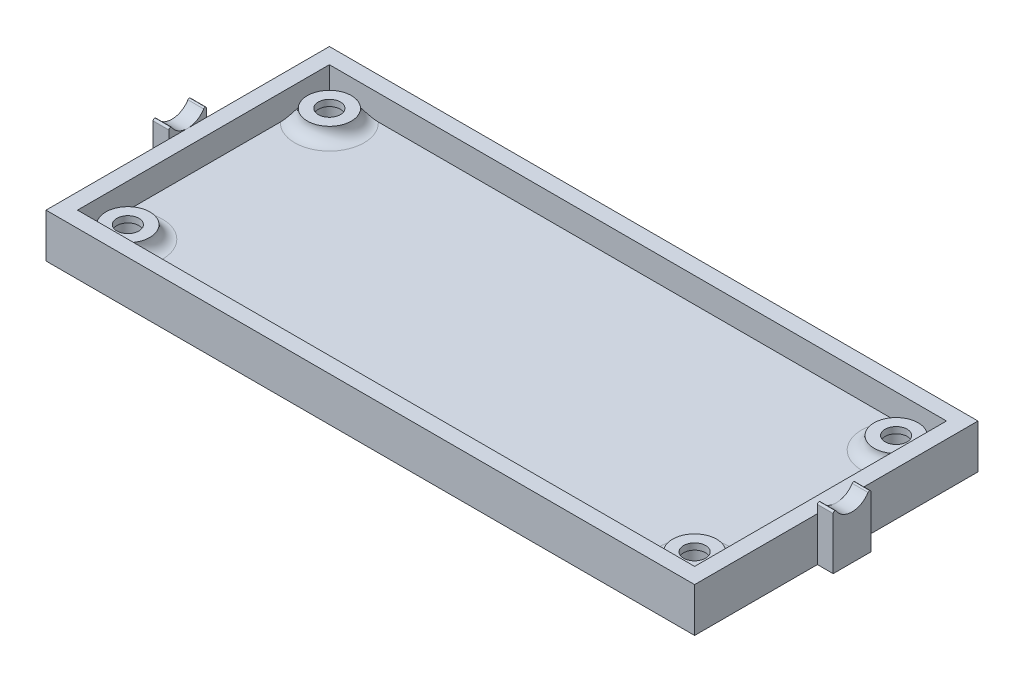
ISO-10303-21;
HEADER;
FILE_DESCRIPTION(('STEP AP214'),'2;1');
FILE_NAME('part.step','',(''),(''),'','','');
FILE_SCHEMA(('AUTOMOTIVE_DESIGN { 1 0 10303 214 1 1 1 1 }'));
ENDSEC;
DATA;
#1=APPLICATION_CONTEXT('core data for automotive mechanical design processes');
#2=APPLICATION_PROTOCOL_DEFINITION('international standard','automotive_design',2000,#1);
#3=PRODUCT_CONTEXT('',#1,'mechanical');
#4=PRODUCT('Part','Part','',(#3));
#5=PRODUCT_RELATED_PRODUCT_CATEGORY('part','',(#4));
#6=PRODUCT_DEFINITION_FORMATION('','',#4);
#7=PRODUCT_DEFINITION_CONTEXT('part definition',#1,'design');
#8=PRODUCT_DEFINITION('design','',#6,#7);
#9=PRODUCT_DEFINITION_SHAPE('','',#8);
#10=(LENGTH_UNIT() NAMED_UNIT(*) SI_UNIT(.MILLI.,.METRE.));
#11=(NAMED_UNIT(*) PLANE_ANGLE_UNIT() SI_UNIT($,.RADIAN.));
#12=(NAMED_UNIT(*) SI_UNIT($,.STERADIAN.) SOLID_ANGLE_UNIT());
#13=UNCERTAINTY_MEASURE_WITH_UNIT(LENGTH_MEASURE(1.E-05),#10,'distance_accuracy_value','');
#14=(GEOMETRIC_REPRESENTATION_CONTEXT(3) GLOBAL_UNCERTAINTY_ASSIGNED_CONTEXT((#13)) GLOBAL_UNIT_ASSIGNED_CONTEXT((#10,
#11,#12)) REPRESENTATION_CONTEXT('',''));
#15=CARTESIAN_POINT('',(0.,0.,0.));
#16=DIRECTION('',(0.,0.,1.));
#17=DIRECTION('',(1.,0.,0.));
#18=AXIS2_PLACEMENT_3D('',#15,#16,#17);
#19=CARTESIAN_POINT('',(0.,3.,0.));
#20=DIRECTION('',(0.,1.,0.));
#21=DIRECTION('',(0.,0.,1.));
#22=AXIS2_PLACEMENT_3D('',#19,#20,#21);
#23=PLANE('',#22);
#24=DIRECTION('',(0.,0.,-1.));
#25=VECTOR('',#24,1.);
#26=CARTESIAN_POINT('',(49.,3.,20.));
#27=LINE('',#26,#25);
#28=CARTESIAN_POINT('',(49.,3.,20.));
#29=VERTEX_POINT('',#28);
#30=CARTESIAN_POINT('',(49.,3.,19.7749172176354));
#31=VERTEX_POINT('',#30);
#32=EDGE_CURVE('E391',#29,#31,#27,.T.);
#33=ORIENTED_EDGE('',*,*,#32,.T.);
#34=CARTESIAN_POINT('',(45.,3.,16.));
#35=DIRECTION('',(0.,1.,0.));
#36=DIRECTION('',(0.,0.,1.));
#37=AXIS2_PLACEMENT_3D('',#34,#35,#36);
#38=CIRCLE('',#37,5.5);
#39=CARTESIAN_POINT('',(48.7749172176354,3.,20.));
#40=VERTEX_POINT('',#39);
#41=EDGE_CURVE('E511',#31,#40,#38,.F.);
#42=ORIENTED_EDGE('',*,*,#41,.T.);
#43=DIRECTION('',(1.,0.,0.));
#44=VECTOR('',#43,1.);
#45=CARTESIAN_POINT('',(-49.,3.,20.));
#46=LINE('',#45,#44);
#47=EDGE_CURVE('E404',#40,#29,#46,.T.);
#48=ORIENTED_EDGE('',*,*,#47,.T.);
#49=EDGE_LOOP('',(#33,#42,#48));
#50=FACE_BOUND('',#49,.T.);
#51=ADVANCED_FACE('F35',(#50),#23,.T.);
#52=CARTESIAN_POINT('',(-41.2250827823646,3.,20.));
#53=VERTEX_POINT('',#52);
#54=CARTESIAN_POINT('',(41.2250827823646,3.,20.));
#55=VERTEX_POINT('',#54);
#56=EDGE_CURVE('E408',#53,#55,#46,.T.);
#57=ORIENTED_EDGE('',*,*,#56,.T.);
#58=CARTESIAN_POINT('',(45.,3.,16.));
#59=DIRECTION('',(0.,1.,0.));
#60=DIRECTION('',(0.,0.,1.));
#61=AXIS2_PLACEMENT_3D('',#58,#59,#60);
#62=CIRCLE('',#61,5.5);
#63=CARTESIAN_POINT('',(49.,3.,12.2250827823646));
#64=VERTEX_POINT('',#63);
#65=EDGE_CURVE('E509',#55,#64,#62,.F.);
#66=ORIENTED_EDGE('',*,*,#65,.T.);
#67=CARTESIAN_POINT('',(49.,3.,-12.2250827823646));
#68=VERTEX_POINT('',#67);
#69=EDGE_CURVE('E395',#64,#68,#27,.T.);
#70=ORIENTED_EDGE('',*,*,#69,.T.);
#71=CARTESIAN_POINT('',(45.,3.,-16.));
#72=DIRECTION('',(0.,1.,0.));
#73=DIRECTION('',(0.,0.,1.));
#74=AXIS2_PLACEMENT_3D('',#71,#72,#73);
#75=CIRCLE('',#74,5.5);
#76=CARTESIAN_POINT('',(41.2250827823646,3.,-20.));
#77=VERTEX_POINT('',#76);
#78=EDGE_CURVE('E501',#68,#77,#75,.F.);
#79=ORIENTED_EDGE('',*,*,#78,.T.);
#80=DIRECTION('',(-1.,0.,0.));
#81=VECTOR('',#80,1.);
#82=CARTESIAN_POINT('',(49.,3.,-20.));
#83=LINE('',#82,#81);
#84=CARTESIAN_POINT('',(-41.2250827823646,3.,-20.));
#85=VERTEX_POINT('',#84);
#86=EDGE_CURVE('E400',#77,#85,#83,.T.);
#87=ORIENTED_EDGE('',*,*,#86,.T.);
#88=CARTESIAN_POINT('',(-45.,3.,-16.));
#89=DIRECTION('',(0.,1.,0.));
#90=DIRECTION('',(0.,0.,1.));
#91=AXIS2_PLACEMENT_3D('',#88,#89,#90);
#92=CIRCLE('',#91,5.5);
#93=CARTESIAN_POINT('',(-49.,3.,-12.2250827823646));
#94=VERTEX_POINT('',#93);
#95=EDGE_CURVE('E496',#85,#94,#92,.F.);
#96=ORIENTED_EDGE('',*,*,#95,.T.);
#97=DIRECTION('',(0.,0.,1.));
#98=VECTOR('',#97,1.);
#99=CARTESIAN_POINT('',(-49.,3.,-20.));
#100=LINE('',#99,#98);
#101=CARTESIAN_POINT('',(-49.,3.,12.2250827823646));
#102=VERTEX_POINT('',#101);
#103=EDGE_CURVE('E405',#94,#102,#100,.T.);
#104=ORIENTED_EDGE('',*,*,#103,.T.);
#105=CARTESIAN_POINT('',(-45.,3.,16.));
#106=DIRECTION('',(0.,1.,0.));
#107=DIRECTION('',(0.,0.,1.));
#108=AXIS2_PLACEMENT_3D('',#105,#106,#107);
#109=CIRCLE('',#108,5.5);
#110=EDGE_CURVE('E506',#102,#53,#109,.F.);
#111=ORIENTED_EDGE('',*,*,#110,.T.);
#112=EDGE_LOOP('',(#57,#66,#70,#79,#87,#96,#104,#111));
#113=FACE_BOUND('',#112,.T.);
#114=ADVANCED_FACE('F597',(#113),#23,.T.);
#115=CARTESIAN_POINT('',(-49.,3.,20.));
#116=VERTEX_POINT('',#115);
#117=CARTESIAN_POINT('',(-48.7749172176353,3.,20.));
#118=VERTEX_POINT('',#117);
#119=EDGE_CURVE('E383',#116,#118,#46,.T.);
#120=ORIENTED_EDGE('',*,*,#119,.T.);
#121=CARTESIAN_POINT('',(-45.,3.,16.));
#122=DIRECTION('',(0.,1.,0.));
#123=DIRECTION('',(0.,0.,1.));
#124=AXIS2_PLACEMENT_3D('',#121,#122,#123);
#125=CIRCLE('',#124,5.5);
#126=CARTESIAN_POINT('',(-49.,3.,19.7749172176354));
#127=VERTEX_POINT('',#126);
#128=EDGE_CURVE('E504',#118,#127,#125,.F.);
#129=ORIENTED_EDGE('',*,*,#128,.T.);
#130=EDGE_CURVE('E399',#127,#116,#100,.T.);
#131=ORIENTED_EDGE('',*,*,#130,.T.);
#132=EDGE_LOOP('',(#120,#129,#131));
#133=FACE_BOUND('',#132,.T.);
#134=ADVANCED_FACE('F607',(#133),#23,.T.);
#135=CARTESIAN_POINT('',(49.,3.,-20.));
#136=VERTEX_POINT('',#135);
#137=CARTESIAN_POINT('',(48.7749172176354,3.,-20.));
#138=VERTEX_POINT('',#137);
#139=EDGE_CURVE('E396',#136,#138,#83,.T.);
#140=ORIENTED_EDGE('',*,*,#139,.T.);
#141=CARTESIAN_POINT('',(45.,3.,-16.));
#142=DIRECTION('',(0.,1.,0.));
#143=DIRECTION('',(0.,0.,1.));
#144=AXIS2_PLACEMENT_3D('',#141,#142,#143);
#145=CIRCLE('',#144,5.5);
#146=CARTESIAN_POINT('',(49.,3.,-19.7749172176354));
#147=VERTEX_POINT('',#146);
#148=EDGE_CURVE('E499',#138,#147,#145,.F.);
#149=ORIENTED_EDGE('',*,*,#148,.T.);
#150=EDGE_CURVE('E379',#147,#136,#27,.T.);
#151=ORIENTED_EDGE('',*,*,#150,.T.);
#152=EDGE_LOOP('',(#140,#149,#151));
#153=FACE_BOUND('',#152,.T.);
#154=ADVANCED_FACE('F604',(#153),#23,.T.);
#155=CARTESIAN_POINT('',(-45.,4.,16.));
#156=DIRECTION('',(0.,-1.,0.));
#157=DIRECTION('',(0.,0.,-1.));
#158=AXIS2_PLACEMENT_3D('',#155,#156,#157);
#159=CYLINDRICAL_SURFACE('',#158,2.);
#160=CARTESIAN_POINT('',(-45.,4.,16.));
#161=DIRECTION('',(0.,-1.,0.));
#162=DIRECTION('',(0.,0.,-1.));
#163=AXIS2_PLACEMENT_3D('',#160,#161,#162);
#164=CIRCLE('',#163,2.);
#165=CARTESIAN_POINT('',(-45.,4.,14.));
#166=VERTEX_POINT('',#165);
#167=EDGE_CURVE('E357',#166,#166,#164,.T.);
#168=ORIENTED_EDGE('',*,*,#167,.F.);
#169=EDGE_LOOP('',(#168));
#170=FACE_BOUND('',#169,.T.);
#171=CARTESIAN_POINT('',(-45.,1.,16.));
#172=DIRECTION('',(0.,-1.,0.));
#173=DIRECTION('',(0.,0.,-1.));
#174=AXIS2_PLACEMENT_3D('',#171,#172,#173);
#175=CIRCLE('',#174,2.);
#176=CARTESIAN_POINT('',(-45.,1.,14.));
#177=VERTEX_POINT('',#176);
#178=EDGE_CURVE('E491',#177,#177,#175,.F.);
#179=ORIENTED_EDGE('',*,*,#178,.F.);
#180=EDGE_LOOP('',(#179));
#181=FACE_BOUND('',#180,.T.);
#182=ADVANCED_FACE('F606',(#170,#181),#159,.F.);
#183=CARTESIAN_POINT('',(45.,4.,16.));
#184=DIRECTION('',(0.,-1.,0.));
#185=DIRECTION('',(0.,0.,-1.));
#186=AXIS2_PLACEMENT_3D('',#183,#184,#185);
#187=CYLINDRICAL_SURFACE('',#186,2.);
#188=CARTESIAN_POINT('',(45.,4.,16.));
#189=DIRECTION('',(0.,-1.,0.));
#190=DIRECTION('',(0.,0.,-1.));
#191=AXIS2_PLACEMENT_3D('',#188,#189,#190);
#192=CIRCLE('',#191,2.);
#193=CARTESIAN_POINT('',(45.,4.,14.));
#194=VERTEX_POINT('',#193);
#195=EDGE_CURVE('E354',#194,#194,#192,.T.);
#196=ORIENTED_EDGE('',*,*,#195,.F.);
#197=EDGE_LOOP('',(#196));
#198=FACE_BOUND('',#197,.T.);
#199=CARTESIAN_POINT('',(45.,1.,16.));
#200=DIRECTION('',(0.,-1.,0.));
#201=DIRECTION('',(0.,0.,-1.));
#202=AXIS2_PLACEMENT_3D('',#199,#200,#201);
#203=CIRCLE('',#202,2.);
#204=CARTESIAN_POINT('',(45.,1.,14.));
#205=VERTEX_POINT('',#204);
#206=EDGE_CURVE('E488',#205,#205,#203,.F.);
#207=ORIENTED_EDGE('',*,*,#206,.F.);
#208=EDGE_LOOP('',(#207));
#209=FACE_BOUND('',#208,.T.);
#210=ADVANCED_FACE('F614',(#198,#209),#187,.F.);
#211=CARTESIAN_POINT('',(45.,4.,-16.));
#212=DIRECTION('',(0.,-1.,0.));
#213=DIRECTION('',(0.,0.,-1.));
#214=AXIS2_PLACEMENT_3D('',#211,#212,#213);
#215=CYLINDRICAL_SURFACE('',#214,2.);
#216=CARTESIAN_POINT('',(45.,4.,-16.));
#217=DIRECTION('',(0.,-1.,0.));
#218=DIRECTION('',(0.,0.,-1.));
#219=AXIS2_PLACEMENT_3D('',#216,#217,#218);
#220=CIRCLE('',#219,2.);
#221=CARTESIAN_POINT('',(45.,4.,-18.));
#222=VERTEX_POINT('',#221);
#223=EDGE_CURVE('E358',#222,#222,#220,.T.);
#224=ORIENTED_EDGE('',*,*,#223,.F.);
#225=EDGE_LOOP('',(#224));
#226=FACE_BOUND('',#225,.T.);
#227=CARTESIAN_POINT('',(45.,1.,-16.));
#228=DIRECTION('',(0.,-1.,0.));
#229=DIRECTION('',(0.,0.,-1.));
#230=AXIS2_PLACEMENT_3D('',#227,#228,#229);
#231=CIRCLE('',#230,2.);
#232=CARTESIAN_POINT('',(45.,1.,-18.));
#233=VERTEX_POINT('',#232);
#234=EDGE_CURVE('E484',#233,#233,#231,.F.);
#235=ORIENTED_EDGE('',*,*,#234,.F.);
#236=EDGE_LOOP('',(#235));
#237=FACE_BOUND('',#236,.T.);
#238=ADVANCED_FACE('F797',(#226,#237),#215,.F.);
#239=CARTESIAN_POINT('',(-45.,4.,-16.));
#240=DIRECTION('',(0.,-1.,0.));
#241=DIRECTION('',(0.,0.,-1.));
#242=AXIS2_PLACEMENT_3D('',#239,#240,#241);
#243=CYLINDRICAL_SURFACE('',#242,2.);
#244=CARTESIAN_POINT('',(-45.,4.,-16.));
#245=DIRECTION('',(0.,-1.,0.));
#246=DIRECTION('',(0.,0.,-1.));
#247=AXIS2_PLACEMENT_3D('',#244,#245,#246);
#248=CIRCLE('',#247,2.);
#249=CARTESIAN_POINT('',(-45.,4.,-18.));
#250=VERTEX_POINT('',#249);
#251=EDGE_CURVE('E353',#250,#250,#248,.T.);
#252=ORIENTED_EDGE('',*,*,#251,.F.);
#253=EDGE_LOOP('',(#252));
#254=FACE_BOUND('',#253,.T.);
#255=CARTESIAN_POINT('',(-45.,1.,-16.));
#256=DIRECTION('',(0.,-1.,0.));
#257=DIRECTION('',(0.,0.,-1.));
#258=AXIS2_PLACEMENT_3D('',#255,#256,#257);
#259=CIRCLE('',#258,2.);
#260=CARTESIAN_POINT('',(-45.,1.,-18.));
#261=VERTEX_POINT('',#260);
#262=EDGE_CURVE('E481',#261,#261,#259,.F.);
#263=ORIENTED_EDGE('',*,*,#262,.F.);
#264=EDGE_LOOP('',(#263));
#265=FACE_BOUND('',#264,.T.);
#266=ADVANCED_FACE('F713',(#254,#265),#243,.F.);
#267=CARTESIAN_POINT('',(-51.5,3.,-22.5));
#268=DIRECTION('',(1.,0.,0.));
#269=DIRECTION('',(0.,0.,-1.));
#270=AXIS2_PLACEMENT_3D('',#267,#268,#269);
#271=PLANE('',#270);
#272=DIRECTION('',(0.,0.,1.));
#273=VECTOR('',#272,1.);
#274=CARTESIAN_POINT('',(-51.5,7.,-22.5));
#275=LINE('',#274,#273);
#276=CARTESIAN_POINT('',(-51.5,7.,3.00000000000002));
#277=VERTEX_POINT('',#276);
#278=CARTESIAN_POINT('',(-51.5,7.,22.5));
#279=VERTEX_POINT('',#278);
#280=EDGE_CURVE('E431',#277,#279,#275,.T.);
#281=ORIENTED_EDGE('',*,*,#280,.F.);
#282=DIRECTION('',(0.,-1.,0.));
#283=VECTOR('',#282,1.);
#284=CARTESIAN_POINT('',(-51.5,3.,3.00000000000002));
#285=LINE('',#284,#283);
#286=CARTESIAN_POINT('',(-51.5,0.,3.00000000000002));
#287=VERTEX_POINT('',#286);
#288=EDGE_CURVE('E296',#277,#287,#285,.T.);
#289=ORIENTED_EDGE('',*,*,#288,.T.);
#290=DIRECTION('',(0.,0.,1.));
#291=VECTOR('',#290,1.);
#292=CARTESIAN_POINT('',(-51.5,0.,-22.5));
#293=LINE('',#292,#291);
#294=CARTESIAN_POINT('',(-51.5,0.,22.5));
#295=VERTEX_POINT('',#294);
#296=EDGE_CURVE('E453',#287,#295,#293,.T.);
#297=ORIENTED_EDGE('',*,*,#296,.T.);
#298=DIRECTION('',(0.,-1.,0.));
#299=VECTOR('',#298,1.);
#300=CARTESIAN_POINT('',(-51.5,3.,22.5));
#301=LINE('',#300,#299);
#302=EDGE_CURVE('E462',#279,#295,#301,.T.);
#303=ORIENTED_EDGE('',*,*,#302,.F.);
#304=EDGE_LOOP('',(#281,#289,#297,#303));
#305=FACE_BOUND('',#304,.T.);
#306=ADVANCED_FACE('F692',(#305),#271,.F.);
#307=CARTESIAN_POINT('',(51.5,3.,-22.5));
#308=DIRECTION('',(-1.,0.,0.));
#309=DIRECTION('',(0.,0.,1.));
#310=AXIS2_PLACEMENT_3D('',#307,#308,#309);
#311=PLANE('',#310);
#312=DIRECTION('',(0.,-1.,0.));
#313=VECTOR('',#312,1.);
#314=CARTESIAN_POINT('',(51.5,8.26794919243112,2.99999999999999));
#315=LINE('',#314,#313);
#316=CARTESIAN_POINT('',(51.5,7.,3.));
#317=VERTEX_POINT('',#316);
#318=CARTESIAN_POINT('',(51.5,0.,2.99999999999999));
#319=VERTEX_POINT('',#318);
#320=EDGE_CURVE('E335',#317,#319,#315,.T.);
#321=ORIENTED_EDGE('',*,*,#320,.F.);
#322=DIRECTION('',(0.,0.,-1.));
#323=VECTOR('',#322,1.);
#324=CARTESIAN_POINT('',(51.5,7.,22.5));
#325=LINE('',#324,#323);
#326=CARTESIAN_POINT('',(51.5,7.,22.5));
#327=VERTEX_POINT('',#326);
#328=EDGE_CURVE('E424',#327,#317,#325,.T.);
#329=ORIENTED_EDGE('',*,*,#328,.F.);
#330=DIRECTION('',(0.,-1.,0.));
#331=VECTOR('',#330,1.);
#332=CARTESIAN_POINT('',(51.5,3.,22.5));
#333=LINE('',#332,#331);
#334=CARTESIAN_POINT('',(51.5,0.,22.5));
#335=VERTEX_POINT('',#334);
#336=EDGE_CURVE('E459',#327,#335,#333,.T.);
#337=ORIENTED_EDGE('',*,*,#336,.T.);
#338=DIRECTION('',(0.,0.,-1.));
#339=VECTOR('',#338,1.);
#340=CARTESIAN_POINT('',(51.5,0.,-22.5));
#341=LINE('',#340,#339);
#342=EDGE_CURVE('E449',#335,#319,#341,.T.);
#343=ORIENTED_EDGE('',*,*,#342,.T.);
#344=EDGE_LOOP('',(#321,#329,#337,#343));
#345=FACE_BOUND('',#344,.T.);
#346=ADVANCED_FACE('F703',(#345),#311,.F.);
#347=DIRECTION('',(0.,1.,0.));
#348=VECTOR('',#347,1.);
#349=CARTESIAN_POINT('',(51.5,0.,-3.00000000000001));
#350=LINE('',#349,#348);
#351=CARTESIAN_POINT('',(51.5,0.,-3.00000000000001));
#352=VERTEX_POINT('',#351);
#353=CARTESIAN_POINT('',(51.5,7.,-3.00000000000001));
#354=VERTEX_POINT('',#353);
#355=EDGE_CURVE('E322',#352,#354,#350,.T.);
#356=ORIENTED_EDGE('',*,*,#355,.F.);
#357=CARTESIAN_POINT('',(51.5,0.,-22.5));
#358=VERTEX_POINT('',#357);
#359=EDGE_CURVE('E448',#352,#358,#341,.T.);
#360=ORIENTED_EDGE('',*,*,#359,.T.);
#361=DIRECTION('',(0.,-1.,0.));
#362=VECTOR('',#361,1.);
#363=CARTESIAN_POINT('',(51.5,3.,-22.5));
#364=LINE('',#363,#362);
#365=CARTESIAN_POINT('',(51.5,7.,-22.5));
#366=VERTEX_POINT('',#365);
#367=EDGE_CURVE('E468',#366,#358,#364,.T.);
#368=ORIENTED_EDGE('',*,*,#367,.F.);
#369=EDGE_CURVE('E423',#354,#366,#325,.T.);
#370=ORIENTED_EDGE('',*,*,#369,.F.);
#371=EDGE_LOOP('',(#356,#360,#368,#370));
#372=FACE_BOUND('',#371,.T.);
#373=ADVANCED_FACE('F705',(#372),#311,.F.);
#374=CARTESIAN_POINT('',(-45.,0.,-16.));
#375=DIRECTION('',(0.,1.,0.));
#376=DIRECTION('',(0.,0.,1.));
#377=AXIS2_PLACEMENT_3D('',#374,#375,#376);
#378=CYLINDRICAL_SURFACE('',#377,1.75);
#379=CARTESIAN_POINT('',(-45.,5.,-16.));
#380=DIRECTION('',(0.,1.,0.));
#381=DIRECTION('',(0.,0.,1.));
#382=AXIS2_PLACEMENT_3D('',#379,#380,#381);
#383=CIRCLE('',#382,1.75);
#384=CARTESIAN_POINT('',(-45.,5.,-14.25));
#385=VERTEX_POINT('',#384);
#386=EDGE_CURVE('E369',#385,#385,#383,.T.);
#387=ORIENTED_EDGE('',*,*,#386,.T.);
#388=EDGE_LOOP('',(#387));
#389=FACE_BOUND('',#388,.T.);
#390=CARTESIAN_POINT('',(-45.,4.,-16.));
#391=DIRECTION('',(0.,-1.,0.));
#392=DIRECTION('',(0.,0.,-1.));
#393=AXIS2_PLACEMENT_3D('',#390,#391,#392);
#394=CIRCLE('',#393,1.75);
#395=CARTESIAN_POINT('',(-45.,4.,-17.75));
#396=VERTEX_POINT('',#395);
#397=EDGE_CURVE('E376',#396,#396,#394,.F.);
#398=ORIENTED_EDGE('',*,*,#397,.F.);
#399=EDGE_LOOP('',(#398));
#400=FACE_BOUND('',#399,.T.);
#401=ADVANCED_FACE('F711',(#389,#400),#378,.F.);
#402=CARTESIAN_POINT('',(45.,0.,-16.));
#403=DIRECTION('',(0.,1.,0.));
#404=DIRECTION('',(0.,0.,1.));
#405=AXIS2_PLACEMENT_3D('',#402,#403,#404);
#406=CYLINDRICAL_SURFACE('',#405,1.75);
#407=CARTESIAN_POINT('',(45.,5.,-16.));
#408=DIRECTION('',(0.,1.,0.));
#409=DIRECTION('',(0.,0.,1.));
#410=AXIS2_PLACEMENT_3D('',#407,#408,#409);
#411=CIRCLE('',#410,1.75);
#412=CARTESIAN_POINT('',(45.,5.,-14.25));
#413=VERTEX_POINT('',#412);
#414=EDGE_CURVE('E366',#413,#413,#411,.T.);
#415=ORIENTED_EDGE('',*,*,#414,.T.);
#416=EDGE_LOOP('',(#415));
#417=FACE_BOUND('',#416,.T.);
#418=CARTESIAN_POINT('',(45.,4.,-16.));
#419=DIRECTION('',(0.,-1.,0.));
#420=DIRECTION('',(0.,0.,-1.));
#421=AXIS2_PLACEMENT_3D('',#418,#419,#420);
#422=CIRCLE('',#421,1.75);
#423=CARTESIAN_POINT('',(45.,4.,-17.75));
#424=VERTEX_POINT('',#423);
#425=EDGE_CURVE('E476',#424,#424,#422,.F.);
#426=ORIENTED_EDGE('',*,*,#425,.F.);
#427=EDGE_LOOP('',(#426));
#428=FACE_BOUND('',#427,.T.);
#429=ADVANCED_FACE('F814',(#417,#428),#406,.F.);
#430=CARTESIAN_POINT('',(45.,0.,16.));
#431=DIRECTION('',(0.,1.,0.));
#432=DIRECTION('',(0.,0.,1.));
#433=AXIS2_PLACEMENT_3D('',#430,#431,#432);
#434=CYLINDRICAL_SURFACE('',#433,1.75);
#435=CARTESIAN_POINT('',(45.,5.,16.));
#436=DIRECTION('',(0.,1.,0.));
#437=DIRECTION('',(0.,0.,1.));
#438=AXIS2_PLACEMENT_3D('',#435,#436,#437);
#439=CIRCLE('',#438,1.75);
#440=CARTESIAN_POINT('',(45.,5.,17.75));
#441=VERTEX_POINT('',#440);
#442=EDGE_CURVE('E370',#441,#441,#439,.T.);
#443=ORIENTED_EDGE('',*,*,#442,.T.);
#444=EDGE_LOOP('',(#443));
#445=FACE_BOUND('',#444,.T.);
#446=CARTESIAN_POINT('',(45.,4.,16.));
#447=DIRECTION('',(0.,-1.,0.));
#448=DIRECTION('',(0.,0.,-1.));
#449=AXIS2_PLACEMENT_3D('',#446,#447,#448);
#450=CIRCLE('',#449,1.75);
#451=CARTESIAN_POINT('',(45.,4.,14.25));
#452=VERTEX_POINT('',#451);
#453=EDGE_CURVE('E473',#452,#452,#450,.F.);
#454=ORIENTED_EDGE('',*,*,#453,.F.);
#455=EDGE_LOOP('',(#454));
#456=FACE_BOUND('',#455,.T.);
#457=ADVANCED_FACE('F817',(#445,#456),#434,.F.);
#458=CARTESIAN_POINT('',(-45.,0.,16.));
#459=DIRECTION('',(0.,1.,0.));
#460=DIRECTION('',(0.,0.,1.));
#461=AXIS2_PLACEMENT_3D('',#458,#459,#460);
#462=CYLINDRICAL_SURFACE('',#461,1.75);
#463=CARTESIAN_POINT('',(-45.,5.,16.));
#464=DIRECTION('',(0.,1.,0.));
#465=DIRECTION('',(0.,0.,1.));
#466=AXIS2_PLACEMENT_3D('',#463,#464,#465);
#467=CIRCLE('',#466,1.75);
#468=CARTESIAN_POINT('',(-45.,5.,17.75));
#469=VERTEX_POINT('',#468);
#470=EDGE_CURVE('E373',#469,#469,#467,.T.);
#471=ORIENTED_EDGE('',*,*,#470,.T.);
#472=EDGE_LOOP('',(#471));
#473=FACE_BOUND('',#472,.T.);
#474=CARTESIAN_POINT('',(-45.,4.,16.));
#475=DIRECTION('',(0.,-1.,0.));
#476=DIRECTION('',(0.,0.,-1.));
#477=AXIS2_PLACEMENT_3D('',#474,#475,#476);
#478=CIRCLE('',#477,1.75);
#479=CARTESIAN_POINT('',(-45.,4.,14.25));
#480=VERTEX_POINT('',#479);
#481=EDGE_CURVE('E365',#480,#480,#478,.F.);
#482=ORIENTED_EDGE('',*,*,#481,.F.);
#483=EDGE_LOOP('',(#482));
#484=FACE_BOUND('',#483,.T.);
#485=ADVANCED_FACE('F622',(#473,#484),#462,.F.);
#486=CARTESIAN_POINT('',(-49.,3.,-20.));
#487=VERTEX_POINT('',#486);
#488=CARTESIAN_POINT('',(-49.,3.,-19.7749172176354));
#489=VERTEX_POINT('',#488);
#490=EDGE_CURVE('E401',#487,#489,#100,.T.);
#491=ORIENTED_EDGE('',*,*,#490,.T.);
#492=CARTESIAN_POINT('',(-45.,3.,-16.));
#493=DIRECTION('',(0.,1.,0.));
#494=DIRECTION('',(0.,0.,1.));
#495=AXIS2_PLACEMENT_3D('',#492,#493,#494);
#496=CIRCLE('',#495,5.5);
#497=CARTESIAN_POINT('',(-48.7749172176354,3.,-20.));
#498=VERTEX_POINT('',#497);
#499=EDGE_CURVE('E494',#489,#498,#496,.F.);
#500=ORIENTED_EDGE('',*,*,#499,.T.);
#501=EDGE_CURVE('E394',#498,#487,#83,.T.);
#502=ORIENTED_EDGE('',*,*,#501,.T.);
#503=EDGE_LOOP('',(#491,#500,#502));
#504=FACE_BOUND('',#503,.T.);
#505=ADVANCED_FACE('F609',(#504),#23,.T.);
#506=CARTESIAN_POINT('',(-45.,5.,-16.));
#507=DIRECTION('',(0.,1.,0.));
#508=DIRECTION('',(0.,0.,1.));
#509=AXIS2_PLACEMENT_3D('',#506,#507,#508);
#510=PLANE('',#509);
#511=ORIENTED_EDGE('',*,*,#386,.F.);
#512=EDGE_LOOP('',(#511));
#513=FACE_BOUND('',#512,.T.);
#514=CARTESIAN_POINT('',(-45.,5.,-16.));
#515=DIRECTION('',(0.,1.,0.));
#516=DIRECTION('',(0.,0.,1.));
#517=AXIS2_PLACEMENT_3D('',#514,#515,#516);
#518=CIRCLE('',#517,3.5);
#519=CARTESIAN_POINT('',(-45.,5.,-12.5));
#520=VERTEX_POINT('',#519);
#521=EDGE_CURVE('E445',#520,#520,#518,.T.);
#522=ORIENTED_EDGE('',*,*,#521,.T.);
#523=EDGE_LOOP('',(#522));
#524=FACE_BOUND('',#523,.T.);
#525=ADVANCED_FACE('F621',(#513,#524),#510,.T.);
#526=CARTESIAN_POINT('',(45.,5.,-16.));
#527=DIRECTION('',(0.,1.,0.));
#528=DIRECTION('',(0.,0.,1.));
#529=AXIS2_PLACEMENT_3D('',#526,#527,#528);
#530=PLANE('',#529);
#531=ORIENTED_EDGE('',*,*,#414,.F.);
#532=EDGE_LOOP('',(#531));
#533=FACE_BOUND('',#532,.T.);
#534=CARTESIAN_POINT('',(45.,5.,-16.));
#535=DIRECTION('',(0.,1.,0.));
#536=DIRECTION('',(0.,0.,1.));
#537=AXIS2_PLACEMENT_3D('',#534,#535,#536);
#538=CIRCLE('',#537,3.5);
#539=CARTESIAN_POINT('',(45.,5.,-12.5));
#540=VERTEX_POINT('',#539);
#541=EDGE_CURVE('E442',#540,#540,#538,.T.);
#542=ORIENTED_EDGE('',*,*,#541,.T.);
#543=EDGE_LOOP('',(#542));
#544=FACE_BOUND('',#543,.T.);
#545=ADVANCED_FACE('F638',(#533,#544),#530,.T.);
#546=CARTESIAN_POINT('',(45.,5.,16.));
#547=DIRECTION('',(0.,1.,0.));
#548=DIRECTION('',(0.,0.,1.));
#549=AXIS2_PLACEMENT_3D('',#546,#547,#548);
#550=PLANE('',#549);
#551=ORIENTED_EDGE('',*,*,#442,.F.);
#552=EDGE_LOOP('',(#551));
#553=FACE_BOUND('',#552,.T.);
#554=CARTESIAN_POINT('',(45.,5.,16.));
#555=DIRECTION('',(0.,1.,0.));
#556=DIRECTION('',(0.,0.,1.));
#557=AXIS2_PLACEMENT_3D('',#554,#555,#556);
#558=CIRCLE('',#557,3.5);
#559=CARTESIAN_POINT('',(45.,5.,19.5));
#560=VERTEX_POINT('',#559);
#561=EDGE_CURVE('E439',#560,#560,#558,.T.);
#562=ORIENTED_EDGE('',*,*,#561,.T.);
#563=EDGE_LOOP('',(#562));
#564=FACE_BOUND('',#563,.T.);
#565=ADVANCED_FACE('F635',(#553,#564),#550,.T.);
#566=CARTESIAN_POINT('',(-45.,5.,16.));
#567=DIRECTION('',(0.,1.,0.));
#568=DIRECTION('',(0.,0.,1.));
#569=AXIS2_PLACEMENT_3D('',#566,#567,#568);
#570=PLANE('',#569);
#571=ORIENTED_EDGE('',*,*,#470,.F.);
#572=EDGE_LOOP('',(#571));
#573=FACE_BOUND('',#572,.T.);
#574=CARTESIAN_POINT('',(-45.,5.,16.));
#575=DIRECTION('',(0.,1.,0.));
#576=DIRECTION('',(0.,0.,1.));
#577=AXIS2_PLACEMENT_3D('',#574,#575,#576);
#578=CIRCLE('',#577,3.5);
#579=CARTESIAN_POINT('',(-45.,5.,19.5));
#580=VERTEX_POINT('',#579);
#581=EDGE_CURVE('E435',#580,#580,#578,.T.);
#582=ORIENTED_EDGE('',*,*,#581,.T.);
#583=EDGE_LOOP('',(#582));
#584=FACE_BOUND('',#583,.T.);
#585=ADVANCED_FACE('F637',(#573,#584),#570,.T.);
#586=CARTESIAN_POINT('',(0.,7.,0.));
#587=DIRECTION('',(0.,1.,0.));
#588=DIRECTION('',(0.,0.,1.));
#589=AXIS2_PLACEMENT_3D('',#586,#587,#588);
#590=PLANE('',#589);
#591=DIRECTION('',(1.,0.,0.));
#592=VECTOR('',#591,1.);
#593=CARTESIAN_POINT('',(-51.5,7.,22.5));
#594=LINE('',#593,#592);
#595=EDGE_CURVE('E420',#279,#327,#594,.T.);
#596=ORIENTED_EDGE('',*,*,#595,.T.);
#597=ORIENTED_EDGE('',*,*,#328,.T.);
#598=CARTESIAN_POINT('',(51.5,7.,0.));
#599=VERTEX_POINT('',#598);
#600=EDGE_CURVE('E428',#317,#599,#325,.T.);
#601=ORIENTED_EDGE('',*,*,#600,.T.);
#602=EDGE_CURVE('E730',#599,#354,#325,.T.);
#603=ORIENTED_EDGE('',*,*,#602,.T.);
#604=ORIENTED_EDGE('',*,*,#369,.T.);
#605=DIRECTION('',(-1.,0.,0.));
#606=VECTOR('',#605,1.);
#607=CARTESIAN_POINT('',(51.5,7.,-22.5));
#608=LINE('',#607,#606);
#609=CARTESIAN_POINT('',(-51.5,7.,-22.5));
#610=VERTEX_POINT('',#609);
#611=EDGE_CURVE('E427',#366,#610,#608,.T.);
#612=ORIENTED_EDGE('',*,*,#611,.T.);
#613=CARTESIAN_POINT('',(-51.5,7.,-2.99999999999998));
#614=VERTEX_POINT('',#613);
#615=EDGE_CURVE('E432',#610,#614,#275,.T.);
#616=ORIENTED_EDGE('',*,*,#615,.T.);
#617=CARTESIAN_POINT('',(-51.5,7.,0.));
#618=VERTEX_POINT('',#617);
#619=EDGE_CURVE('E436',#614,#618,#275,.T.);
#620=ORIENTED_EDGE('',*,*,#619,.T.);
#621=EDGE_CURVE('E762',#618,#277,#275,.T.);
#622=ORIENTED_EDGE('',*,*,#621,.T.);
#623=ORIENTED_EDGE('',*,*,#280,.T.);
#624=EDGE_LOOP('',(#596,#597,#601,#603,#604,#612,#616,#620,#622,#623));
#625=FACE_BOUND('',#624,.T.);
#626=DIRECTION('',(-1.,0.,0.));
#627=VECTOR('',#626,1.);
#628=CARTESIAN_POINT('',(49.,7.,-20.));
#629=LINE('',#628,#627);
#630=CARTESIAN_POINT('',(49.,7.,-20.));
#631=VERTEX_POINT('',#630);
#632=CARTESIAN_POINT('',(-49.,7.,-20.));
#633=VERTEX_POINT('',#632);
#634=EDGE_CURVE('E382',#631,#633,#629,.T.);
#635=ORIENTED_EDGE('',*,*,#634,.F.);
#636=DIRECTION('',(0.,0.,-1.));
#637=VECTOR('',#636,1.);
#638=CARTESIAN_POINT('',(49.,7.,20.));
#639=LINE('',#638,#637);
#640=CARTESIAN_POINT('',(49.,7.,20.));
#641=VERTEX_POINT('',#640);
#642=EDGE_CURVE('E380',#641,#631,#639,.T.);
#643=ORIENTED_EDGE('',*,*,#642,.F.);
#644=DIRECTION('',(1.,0.,0.));
#645=VECTOR('',#644,1.);
#646=CARTESIAN_POINT('',(-49.,7.,20.));
#647=LINE('',#646,#645);
#648=CARTESIAN_POINT('',(-49.,7.,20.));
#649=VERTEX_POINT('',#648);
#650=EDGE_CURVE('E388',#649,#641,#647,.T.);
#651=ORIENTED_EDGE('',*,*,#650,.F.);
#652=DIRECTION('',(0.,0.,1.));
#653=VECTOR('',#652,1.);
#654=CARTESIAN_POINT('',(-49.,7.,-20.));
#655=LINE('',#654,#653);
#656=EDGE_CURVE('E385',#633,#649,#655,.T.);
#657=ORIENTED_EDGE('',*,*,#656,.F.);
#658=EDGE_LOOP('',(#635,#643,#651,#657));
#659=FACE_BOUND('',#658,.T.);
#660=ADVANCED_FACE('F573',(#625,#659),#590,.T.);
#661=CARTESIAN_POINT('',(49.,7.,20.));
#662=DIRECTION('',(-1.,0.,0.));
#663=DIRECTION('',(0.,0.,1.));
#664=AXIS2_PLACEMENT_3D('',#661,#662,#663);
#665=PLANE('',#664);
#666=ORIENTED_EDGE('',*,*,#69,.F.);
#667=CARTESIAN_POINT('',(49.,3.,12.2250827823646));
#668=CARTESIAN_POINT('',(49.,2.99999808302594,12.3443525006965));
#669=CARTESIAN_POINT('',(49.,3.00502112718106,12.4635010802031));
#670=CARTESIAN_POINT('',(49.,3.02357718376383,12.7010154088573));
#671=CARTESIAN_POINT('',(49.,3.0371005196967,12.819381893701));
#672=CARTESIAN_POINT('',(49.,3.07143664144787,13.0572289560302));
#673=CARTESIAN_POINT('',(49.,3.09237876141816,13.1766900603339));
#674=CARTESIAN_POINT('',(49.,3.13985591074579,13.4144722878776));
#675=CARTESIAN_POINT('',(49.,3.16639092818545,13.5327934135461));
#676=CARTESIAN_POINT('',(49.,3.22338365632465,13.7687005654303));
#677=CARTESIAN_POINT('',(49.,3.25384863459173,13.8862847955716));
#678=CARTESIAN_POINT('',(49.,3.31676038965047,14.1209261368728));
#679=CARTESIAN_POINT('',(49.,3.34920742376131,14.2379831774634));
#680=CARTESIAN_POINT('',(49.,3.41390764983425,14.4723024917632));
#681=CARTESIAN_POINT('',(49.,3.44616056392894,14.5895648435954));
#682=CARTESIAN_POINT('',(49.,3.50775754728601,14.8249004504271));
#683=CARTESIAN_POINT('',(49.,3.53710108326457,14.9429738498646));
#684=CARTESIAN_POINT('',(49.,3.58903770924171,15.1778237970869));
#685=CARTESIAN_POINT('',(49.,3.61176979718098,15.2945682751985));
#686=CARTESIAN_POINT('',(49.,3.64807928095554,15.5294618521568));
#687=CARTESIAN_POINT('',(49.,3.6616636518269,15.6476098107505));
#688=CARTESIAN_POINT('',(49.,3.67714722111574,15.8842439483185));
#689=CARTESIAN_POINT('',(49.,3.67909284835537,16.0027268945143));
#690=CARTESIAN_POINT('',(49.,3.67101129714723,16.2393004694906));
#691=CARTESIAN_POINT('',(49.,3.66098038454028,16.3573909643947));
#692=CARTESIAN_POINT('',(49.,3.63712398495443,16.5437324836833));
#693=CARTESIAN_POINT('',(49.,3.62657319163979,16.6124381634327));
#694=CARTESIAN_POINT('',(49.,3.60265015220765,16.7493362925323));
#695=CARTESIAN_POINT('',(49.,3.5892786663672,16.8175288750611));
#696=CARTESIAN_POINT('',(49.,3.54583538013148,17.0217180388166));
#697=CARTESIAN_POINT('',(49.,3.5124823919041,17.1570012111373));
#698=CARTESIAN_POINT('',(49.,3.44117856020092,17.4295167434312));
#699=CARTESIAN_POINT('',(49.,3.40314164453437,17.5667251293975));
#700=CARTESIAN_POINT('',(49.,3.32734485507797,17.841115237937));
#701=CARTESIAN_POINT('',(49.,3.28958479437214,17.9782969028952));
#702=CARTESIAN_POINT('',(49.,3.21803318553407,18.2524165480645));
#703=CARTESIAN_POINT('',(49.,3.18420930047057,18.3893458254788));
#704=CARTESIAN_POINT('',(49.,3.12300792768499,18.6645928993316));
#705=CARTESIAN_POINT('',(49.,3.09562679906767,18.8029098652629));
#706=CARTESIAN_POINT('',(49.,3.05017958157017,19.0794524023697));
#707=CARTESIAN_POINT('',(49.,3.03200641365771,19.2176594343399));
#708=CARTESIAN_POINT('',(49.,3.0068978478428,19.4954738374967));
#709=CARTESIAN_POINT('',(49.,2.99999614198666,19.6350841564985));
#710=CARTESIAN_POINT('',(49.,3.,19.7749172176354));
#711=B_SPLINE_CURVE_WITH_KNOTS('',3,(#667,#668,#669,#670,#671,#672,#673,#674,#675,#676,#677,
#678,#679,#680,#681,#682,#683,#684,#685,#686,#687,#688,#689,#690,#691,#692,#693,#694,#695,#696,
#697,#698,#699,#700,#701,#702,#703,#704,#705,#706,#707,#708,#709,#710),.UNSPECIFIED.,.F.,.F.,(4,
2,2,2,2,2,2,2,2,2,2,2,2,2,2,2,2,2,2,2,2,4),(0.,0.357529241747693,0.714652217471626,
1.07833504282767,1.44201709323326,1.80638159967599,2.17079351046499,2.53564074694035,
2.90055473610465,3.25712563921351,3.6134243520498,3.96830077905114,4.32328788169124,
4.53176607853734,4.74018815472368,5.1580148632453,5.58517605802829,6.01201585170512,
6.43505571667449,6.85785593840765,7.27561959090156,7.69462972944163),.UNSPECIFIED.);
#712=EDGE_CURVE('E582',#64,#31,#711,.T.);
#713=ORIENTED_EDGE('',*,*,#712,.T.);
#714=ORIENTED_EDGE('',*,*,#32,.F.);
#715=DIRECTION('',(0.,-1.,0.));
#716=VECTOR('',#715,1.);
#717=CARTESIAN_POINT('',(49.,7.,20.));
#718=LINE('',#717,#716);
#719=EDGE_CURVE('E390',#641,#29,#718,.T.);
#720=ORIENTED_EDGE('',*,*,#719,.F.);
#721=ORIENTED_EDGE('',*,*,#642,.T.);
#722=DIRECTION('',(0.,-1.,0.));
#723=VECTOR('',#722,1.);
#724=CARTESIAN_POINT('',(49.,7.,-20.));
#725=LINE('',#724,#723);
#726=EDGE_CURVE('E417',#631,#136,#725,.T.);
#727=ORIENTED_EDGE('',*,*,#726,.T.);
#728=ORIENTED_EDGE('',*,*,#150,.F.);
#729=CARTESIAN_POINT('',(49.,3.,-19.7749172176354));
#730=CARTESIAN_POINT('',(49.,2.99999808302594,-19.6556474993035));
#731=CARTESIAN_POINT('',(49.,3.00502112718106,-19.5364989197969));
#732=CARTESIAN_POINT('',(49.,3.02357718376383,-19.2989845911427));
#733=CARTESIAN_POINT('',(49.,3.0371005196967,-19.180618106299));
#734=CARTESIAN_POINT('',(49.,3.07143664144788,-18.9427710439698));
#735=CARTESIAN_POINT('',(49.,3.09237876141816,-18.8233099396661));
#736=CARTESIAN_POINT('',(49.,3.1398559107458,-18.5855277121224));
#737=CARTESIAN_POINT('',(49.,3.16639092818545,-18.4672065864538));
#738=CARTESIAN_POINT('',(49.,3.22338365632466,-18.2312994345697));
#739=CARTESIAN_POINT('',(49.,3.25384863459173,-18.1137152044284));
#740=CARTESIAN_POINT('',(49.,3.31676038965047,-17.8790738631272));
#741=CARTESIAN_POINT('',(49.,3.34920742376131,-17.7620168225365));
#742=CARTESIAN_POINT('',(49.,3.41390764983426,-17.5276975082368));
#743=CARTESIAN_POINT('',(49.,3.44616056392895,-17.4104351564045));
#744=CARTESIAN_POINT('',(49.,3.50775754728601,-17.1750995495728));
#745=CARTESIAN_POINT('',(49.,3.53710108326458,-17.0570261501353));
#746=CARTESIAN_POINT('',(49.,3.58903770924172,-16.8221762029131));
#747=CARTESIAN_POINT('',(49.,3.61176979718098,-16.7054317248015));
#748=CARTESIAN_POINT('',(49.,3.64807928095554,-16.4705381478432));
#749=CARTESIAN_POINT('',(49.,3.6616636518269,-16.3523901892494));
#750=CARTESIAN_POINT('',(49.,3.67714722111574,-16.1157560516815));
#751=CARTESIAN_POINT('',(49.,3.67909284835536,-15.9972731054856));
#752=CARTESIAN_POINT('',(49.,3.67101129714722,-15.7606995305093));
#753=CARTESIAN_POINT('',(49.,3.66098038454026,-15.6426090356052));
#754=CARTESIAN_POINT('',(49.,3.63712398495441,-15.4562675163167));
#755=CARTESIAN_POINT('',(49.,3.62657319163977,-15.3875618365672));
#756=CARTESIAN_POINT('',(49.,3.60265015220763,-15.2506637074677));
#757=CARTESIAN_POINT('',(49.,3.58927866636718,-15.1824711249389));
#758=CARTESIAN_POINT('',(49.,3.54583538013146,-14.9782819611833));
#759=CARTESIAN_POINT('',(49.,3.51248239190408,-14.8429987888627));
#760=CARTESIAN_POINT('',(49.,3.44117856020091,-14.5704832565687));
#761=CARTESIAN_POINT('',(49.,3.40314164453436,-14.4332748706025));
#762=CARTESIAN_POINT('',(49.,3.32734485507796,-14.158884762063));
#763=CARTESIAN_POINT('',(49.,3.28958479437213,-14.0217030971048));
#764=CARTESIAN_POINT('',(49.,3.21803318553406,-13.7475834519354));
#765=CARTESIAN_POINT('',(49.,3.18420930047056,-13.6106541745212));
#766=CARTESIAN_POINT('',(49.,3.12300792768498,-13.3354071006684));
#767=CARTESIAN_POINT('',(49.,3.09562679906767,-13.1970901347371));
#768=CARTESIAN_POINT('',(49.,3.05017958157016,-12.9205475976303));
#769=CARTESIAN_POINT('',(49.,3.0320064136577,-12.7823405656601));
#770=CARTESIAN_POINT('',(49.,3.0068978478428,-12.5045261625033));
#771=CARTESIAN_POINT('',(49.,2.99999614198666,-12.3649158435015));
#772=CARTESIAN_POINT('',(49.,3.,-12.2250827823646));
#773=B_SPLINE_CURVE_WITH_KNOTS('',3,(#729,#730,#731,#732,#733,#734,#735,#736,#737,#738,#739,
#740,#741,#742,#743,#744,#745,#746,#747,#748,#749,#750,#751,#752,#753,#754,#755,#756,#757,#758,
#759,#760,#761,#762,#763,#764,#765,#766,#767,#768,#769,#770,#771,#772),.UNSPECIFIED.,.F.,.F.,(4,
2,2,2,2,2,2,2,2,2,2,2,2,2,2,2,2,2,2,2,2,4),(0.,0.357529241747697,0.714652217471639,
1.07833504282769,1.44201709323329,1.80638159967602,2.17079351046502,2.53564074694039,
2.90055473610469,3.25712563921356,3.61342435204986,3.96830077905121,4.32328788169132,
4.53176607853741,4.74018815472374,5.15801486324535,5.58517605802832,6.01201585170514,
6.43505571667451,6.85785593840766,7.27561959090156,7.69462972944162),.UNSPECIFIED.);
#774=EDGE_CURVE('E577',#147,#68,#773,.T.);
#775=ORIENTED_EDGE('',*,*,#774,.T.);
#776=EDGE_LOOP('',(#666,#713,#714,#720,#721,#727,#728,#775));
#777=FACE_BOUND('',#776,.T.);
#778=ADVANCED_FACE('F567',(#777),#665,.T.);
#779=CARTESIAN_POINT('',(49.,7.,-20.));
#780=DIRECTION('',(0.,0.,1.));
#781=DIRECTION('',(1.,0.,0.));
#782=AXIS2_PLACEMENT_3D('',#779,#780,#781);
#783=PLANE('',#782);
#784=ORIENTED_EDGE('',*,*,#86,.F.);
#785=CARTESIAN_POINT('',(41.2250827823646,3.,-20.));
#786=CARTESIAN_POINT('',(41.3443525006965,2.99999808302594,-20.));
#787=CARTESIAN_POINT('',(41.4635010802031,3.00502112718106,-20.));
#788=CARTESIAN_POINT('',(41.7010154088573,3.02357718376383,-20.));
#789=CARTESIAN_POINT('',(41.819381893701,3.0371005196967,-20.));
#790=CARTESIAN_POINT('',(42.0572289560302,3.07143664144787,-20.));
#791=CARTESIAN_POINT('',(42.1766900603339,3.09237876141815,-20.));
#792=CARTESIAN_POINT('',(42.4144722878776,3.13985591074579,-20.));
#793=CARTESIAN_POINT('',(42.5327934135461,3.16639092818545,-20.));
#794=CARTESIAN_POINT('',(42.7687005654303,3.22338365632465,-20.));
#795=CARTESIAN_POINT('',(42.8862847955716,3.25384863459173,-20.));
#796=CARTESIAN_POINT('',(43.1209261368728,3.31676038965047,-20.));
#797=CARTESIAN_POINT('',(43.2379831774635,3.34920742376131,-20.));
#798=CARTESIAN_POINT('',(43.4723024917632,3.41390764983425,-20.));
#799=CARTESIAN_POINT('',(43.5895648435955,3.44616056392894,-20.));
#800=CARTESIAN_POINT('',(43.8249004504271,3.50775754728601,-20.));
#801=CARTESIAN_POINT('',(43.9429738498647,3.53710108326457,-20.));
#802=CARTESIAN_POINT('',(44.1778237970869,3.58903770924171,-20.));
#803=CARTESIAN_POINT('',(44.2945682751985,3.61176979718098,-20.));
#804=CARTESIAN_POINT('',(44.5294618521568,3.64807928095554,-20.));
#805=CARTESIAN_POINT('',(44.6476098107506,3.6616636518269,-20.));
#806=CARTESIAN_POINT('',(44.8842439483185,3.67714722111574,-20.));
#807=CARTESIAN_POINT('',(45.0027268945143,3.67909284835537,-20.));
#808=CARTESIAN_POINT('',(45.2393004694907,3.67101129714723,-20.));
#809=CARTESIAN_POINT('',(45.3573909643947,3.66098038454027,-20.));
#810=CARTESIAN_POINT('',(45.5437324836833,3.63712398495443,-20.));
#811=CARTESIAN_POINT('',(45.6124381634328,3.62657319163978,-20.));
#812=CARTESIAN_POINT('',(45.7493362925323,3.60265015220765,-20.));
#813=CARTESIAN_POINT('',(45.8175288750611,3.5892786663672,-20.));
#814=CARTESIAN_POINT('',(46.0217180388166,3.54583538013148,-20.));
#815=CARTESIAN_POINT('',(46.1570012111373,3.5124823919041,-20.));
#816=CARTESIAN_POINT('',(46.4295167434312,3.44117856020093,-20.));
#817=CARTESIAN_POINT('',(46.5667251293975,3.40314164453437,-20.));
#818=CARTESIAN_POINT('',(46.841115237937,3.32734485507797,-20.));
#819=CARTESIAN_POINT('',(46.9782969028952,3.28958479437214,-20.));
#820=CARTESIAN_POINT('',(47.2524165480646,3.21803318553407,-20.));
#821=CARTESIAN_POINT('',(47.3893458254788,3.18420930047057,-20.));
#822=CARTESIAN_POINT('',(47.6645928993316,3.12300792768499,-20.));
#823=CARTESIAN_POINT('',(47.8029098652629,3.09562679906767,-20.));
#824=CARTESIAN_POINT('',(48.0794524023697,3.05017958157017,-20.));
#825=CARTESIAN_POINT('',(48.2176594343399,3.03200641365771,-20.));
#826=CARTESIAN_POINT('',(48.4954738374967,3.0068978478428,-20.));
#827=CARTESIAN_POINT('',(48.6350841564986,2.99999614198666,-20.));
#828=CARTESIAN_POINT('',(48.7749172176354,3.,-20.));
#829=B_SPLINE_CURVE_WITH_KNOTS('',3,(#785,#786,#787,#788,#789,#790,#791,#792,#793,#794,#795,
#796,#797,#798,#799,#800,#801,#802,#803,#804,#805,#806,#807,#808,#809,#810,#811,#812,#813,#814,
#815,#816,#817,#818,#819,#820,#821,#822,#823,#824,#825,#826,#827,#828),.UNSPECIFIED.,.F.,.F.,(4,
2,2,2,2,2,2,2,2,2,2,2,2,2,2,2,2,2,2,2,2,4),(0.,0.357529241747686,0.714652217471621,
1.07833504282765,1.44201709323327,1.806381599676,2.17079351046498,2.53564074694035,
2.90055473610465,3.25712563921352,3.61342435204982,3.96830077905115,4.32328788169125,
4.53176607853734,4.74018815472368,5.15801486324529,5.58517605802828,6.01201585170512,
6.43505571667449,6.85785593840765,7.27561959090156,7.69462972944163),.UNSPECIFIED.);
#830=EDGE_CURVE('E11',#77,#138,#829,.T.);
#831=ORIENTED_EDGE('',*,*,#830,.T.);
#832=ORIENTED_EDGE('',*,*,#139,.F.);
#833=ORIENTED_EDGE('',*,*,#726,.F.);
#834=ORIENTED_EDGE('',*,*,#634,.T.);
#835=DIRECTION('',(0.,-1.,0.));
#836=VECTOR('',#835,1.);
#837=CARTESIAN_POINT('',(-49.,7.,-20.));
#838=LINE('',#837,#836);
#839=EDGE_CURVE('E414',#633,#487,#838,.T.);
#840=ORIENTED_EDGE('',*,*,#839,.T.);
#841=ORIENTED_EDGE('',*,*,#501,.F.);
#842=CARTESIAN_POINT('',(-48.7749172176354,3.,-20.));
#843=CARTESIAN_POINT('',(-48.6556474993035,2.99999808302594,-20.));
#844=CARTESIAN_POINT('',(-48.5364989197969,3.00502112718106,-20.));
#845=CARTESIAN_POINT('',(-48.2989845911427,3.02357718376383,-20.));
#846=CARTESIAN_POINT('',(-48.180618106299,3.0371005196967,-20.));
#847=CARTESIAN_POINT('',(-47.9427710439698,3.07143664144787,-20.));
#848=CARTESIAN_POINT('',(-47.8233099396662,3.09237876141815,-20.));
#849=CARTESIAN_POINT('',(-47.5855277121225,3.13985591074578,-20.));
#850=CARTESIAN_POINT('',(-47.4672065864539,3.16639092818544,-20.));
#851=CARTESIAN_POINT('',(-47.2312994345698,3.22338365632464,-20.));
#852=CARTESIAN_POINT('',(-47.1137152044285,3.25384863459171,-20.));
#853=CARTESIAN_POINT('',(-46.8790738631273,3.31676038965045,-20.));
#854=CARTESIAN_POINT('',(-46.7620168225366,3.34920742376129,-20.));
#855=CARTESIAN_POINT('',(-46.5276975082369,3.41390764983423,-20.));
#856=CARTESIAN_POINT('',(-46.4104351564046,3.44616056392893,-20.));
#857=CARTESIAN_POINT('',(-46.175099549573,3.50775754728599,-20.));
#858=CARTESIAN_POINT('',(-46.0570261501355,3.53710108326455,-20.));
#859=CARTESIAN_POINT('',(-45.8221762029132,3.5890377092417,-20.));
#860=CARTESIAN_POINT('',(-45.7054317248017,3.61176979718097,-20.));
#861=CARTESIAN_POINT('',(-45.4705381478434,3.64807928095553,-20.));
#862=CARTESIAN_POINT('',(-45.3523901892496,3.6616636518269,-20.));
#863=CARTESIAN_POINT('',(-45.1157560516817,3.67714722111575,-20.));
#864=CARTESIAN_POINT('',(-44.9972731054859,3.67909284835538,-20.));
#865=CARTESIAN_POINT('',(-44.7606995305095,3.67101129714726,-20.));
#866=CARTESIAN_POINT('',(-44.6426090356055,3.66098038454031,-20.));
#867=CARTESIAN_POINT('',(-44.4562675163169,3.63712398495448,-20.));
#868=CARTESIAN_POINT('',(-44.3875618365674,3.62657319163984,-20.));
#869=CARTESIAN_POINT('',(-44.2506637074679,3.6026501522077,-20.));
#870=CARTESIAN_POINT('',(-44.1824711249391,3.58927866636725,-20.));
#871=CARTESIAN_POINT('',(-43.9782819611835,3.54583538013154,-20.));
#872=CARTESIAN_POINT('',(-43.8429987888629,3.51248239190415,-20.));
#873=CARTESIAN_POINT('',(-43.5704832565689,3.44117856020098,-20.));
#874=CARTESIAN_POINT('',(-43.4332748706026,3.40314164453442,-20.));
#875=CARTESIAN_POINT('',(-43.1588847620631,3.32734485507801,-20.));
#876=CARTESIAN_POINT('',(-43.0217030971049,3.28958479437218,-20.));
#877=CARTESIAN_POINT('',(-42.7475834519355,3.2180331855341,-20.));
#878=CARTESIAN_POINT('',(-42.6106541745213,3.18420930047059,-20.));
#879=CARTESIAN_POINT('',(-42.3354071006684,3.123007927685,-20.));
#880=CARTESIAN_POINT('',(-42.1970901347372,3.09562679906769,-20.));
#881=CARTESIAN_POINT('',(-41.9205475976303,3.05017958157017,-20.));
#882=CARTESIAN_POINT('',(-41.7823405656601,3.03200641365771,-20.));
#883=CARTESIAN_POINT('',(-41.5045261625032,3.0068978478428,-20.));
#884=CARTESIAN_POINT('',(-41.3649158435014,2.99999614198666,-20.));
#885=CARTESIAN_POINT('',(-41.2250827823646,3.,-20.));
#886=B_SPLINE_CURVE_WITH_KNOTS('',3,(#842,#843,#844,#845,#846,#847,#848,#849,#850,#851,#852,
#853,#854,#855,#856,#857,#858,#859,#860,#861,#862,#863,#864,#865,#866,#867,#868,#869,#870,#871,
#872,#873,#874,#875,#876,#877,#878,#879,#880,#881,#882,#883,#884,#885),.UNSPECIFIED.,.F.,.F.,(4,
2,2,2,2,2,2,2,2,2,2,2,2,2,2,2,2,2,2,2,2,4),(0.,0.357529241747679,0.714652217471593,
1.07833504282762,1.4420170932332,1.80638159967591,2.17079351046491,2.53564074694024,
2.90055473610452,3.25712563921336,3.61342435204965,3.96830077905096,4.32328788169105,
4.53176607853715,4.74018815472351,5.15801486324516,5.58517605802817,6.01201585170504,
6.43505571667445,6.85785593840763,7.27561959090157,7.69462972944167),.UNSPECIFIED.);
#887=EDGE_CURVE('E49',#498,#85,#886,.T.);
#888=ORIENTED_EDGE('',*,*,#887,.T.);
#889=EDGE_LOOP('',(#784,#831,#832,#833,#834,#840,#841,#888));
#890=FACE_BOUND('',#889,.T.);
#891=ADVANCED_FACE('F561',(#890),#783,.T.);
#892=CARTESIAN_POINT('',(-49.,7.,-20.));
#893=DIRECTION('',(1.,0.,0.));
#894=DIRECTION('',(0.,0.,-1.));
#895=AXIS2_PLACEMENT_3D('',#892,#893,#894);
#896=PLANE('',#895);
#897=ORIENTED_EDGE('',*,*,#130,.F.);
#898=CARTESIAN_POINT('',(-49.,3.,19.7749172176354));
#899=CARTESIAN_POINT('',(-49.,2.99999808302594,19.6556474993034));
#900=CARTESIAN_POINT('',(-49.,3.00502112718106,19.5364989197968));
#901=CARTESIAN_POINT('',(-49.,3.02357718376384,19.2989845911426));
#902=CARTESIAN_POINT('',(-49.,3.0371005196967,19.1806181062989));
#903=CARTESIAN_POINT('',(-49.,3.07143664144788,18.9427710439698));
#904=CARTESIAN_POINT('',(-49.,3.09237876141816,18.8233099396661));
#905=CARTESIAN_POINT('',(-49.,3.1398559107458,18.5855277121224));
#906=CARTESIAN_POINT('',(-49.,3.16639092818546,18.4672065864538));
#907=CARTESIAN_POINT('',(-49.,3.22338365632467,18.2312994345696));
#908=CARTESIAN_POINT('',(-49.,3.25384863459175,18.1137152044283));
#909=CARTESIAN_POINT('',(-49.,3.31676038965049,17.8790738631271));
#910=CARTESIAN_POINT('',(-49.,3.34920742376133,17.7620168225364));
#911=CARTESIAN_POINT('',(-49.,3.41390764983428,17.5276975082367));
#912=CARTESIAN_POINT('',(-49.,3.44616056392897,17.4104351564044));
#913=CARTESIAN_POINT('',(-49.,3.50775754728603,17.1750995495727));
#914=CARTESIAN_POINT('',(-49.,3.5371010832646,17.0570261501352));
#915=CARTESIAN_POINT('',(-49.,3.58903770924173,16.8221762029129));
#916=CARTESIAN_POINT('',(-49.,3.611769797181,16.7054317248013));
#917=CARTESIAN_POINT('',(-49.,3.64807928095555,16.470538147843));
#918=CARTESIAN_POINT('',(-49.,3.66166365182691,16.3523901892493));
#919=CARTESIAN_POINT('',(-49.,3.67714722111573,16.1157560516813));
#920=CARTESIAN_POINT('',(-49.,3.67909284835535,15.9972731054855));
#921=CARTESIAN_POINT('',(-49.,3.6710112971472,15.7606995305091));
#922=CARTESIAN_POINT('',(-49.,3.66098038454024,15.642609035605));
#923=CARTESIAN_POINT('',(-49.,3.63712398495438,15.4562675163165));
#924=CARTESIAN_POINT('',(-49.,3.62657319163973,15.387561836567));
#925=CARTESIAN_POINT('',(-49.,3.60265015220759,15.2506637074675));
#926=CARTESIAN_POINT('',(-49.,3.58927866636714,15.1824711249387));
#927=CARTESIAN_POINT('',(-49.,3.54583538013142,14.9782819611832));
#928=CARTESIAN_POINT('',(-49.,3.51248239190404,14.8429987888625));
#929=CARTESIAN_POINT('',(-49.,3.44117856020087,14.5704832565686));
#930=CARTESIAN_POINT('',(-49.,3.40314164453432,14.4332748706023));
#931=CARTESIAN_POINT('',(-49.,3.32734485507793,14.1588847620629));
#932=CARTESIAN_POINT('',(-49.,3.2895847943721,14.0217030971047));
#933=CARTESIAN_POINT('',(-49.,3.21803318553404,13.7475834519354));
#934=CARTESIAN_POINT('',(-49.,3.18420930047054,13.6106541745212));
#935=CARTESIAN_POINT('',(-49.,3.12300792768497,13.3354071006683));
#936=CARTESIAN_POINT('',(-49.,3.09562679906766,13.1970901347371));
#937=CARTESIAN_POINT('',(-49.,3.05017958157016,12.9205475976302));
#938=CARTESIAN_POINT('',(-49.,3.0320064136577,12.7823405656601));
#939=CARTESIAN_POINT('',(-49.,3.0068978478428,12.5045261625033));
#940=CARTESIAN_POINT('',(-49.,2.99999614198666,12.3649158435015));
#941=CARTESIAN_POINT('',(-49.,3.,12.2250827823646));
#942=B_SPLINE_CURVE_WITH_KNOTS('',3,(#898,#899,#900,#901,#902,#903,#904,#905,#906,#907,#908,
#909,#910,#911,#912,#913,#914,#915,#916,#917,#918,#919,#920,#921,#922,#923,#924,#925,#926,#927,
#928,#929,#930,#931,#932,#933,#934,#935,#936,#937,#938,#939,#940,#941),.UNSPECIFIED.,.F.,.F.,(4,
2,2,2,2,2,2,2,2,2,2,2,2,2,2,2,2,2,2,2,2,4),(0.,0.357529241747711,0.714652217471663,
1.07833504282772,1.44201709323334,1.80638159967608,2.1707935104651,2.53564074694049,
2.9005547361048,3.25712563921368,3.61342435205,3.96830077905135,4.32328788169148,
4.53176607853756,4.74018815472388,5.15801486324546,5.58517605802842,6.01201585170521,
6.43505571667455,6.85785593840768,7.27561959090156,7.69462972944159),.UNSPECIFIED.);
#943=EDGE_CURVE('E542',#127,#102,#942,.T.);
#944=ORIENTED_EDGE('',*,*,#943,.T.);
#945=ORIENTED_EDGE('',*,*,#103,.F.);
#946=CARTESIAN_POINT('',(-49.,3.,-12.2250827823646));
#947=CARTESIAN_POINT('',(-49.,2.99999808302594,-12.3443525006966));
#948=CARTESIAN_POINT('',(-49.,3.00502112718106,-12.4635010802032));
#949=CARTESIAN_POINT('',(-49.,3.02357718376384,-12.7010154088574));
#950=CARTESIAN_POINT('',(-49.,3.03710051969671,-12.8193818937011));
#951=CARTESIAN_POINT('',(-49.,3.07143664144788,-13.0572289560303));
#952=CARTESIAN_POINT('',(-49.,3.09237876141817,-13.176690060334));
#953=CARTESIAN_POINT('',(-49.,3.13985591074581,-13.4144722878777));
#954=CARTESIAN_POINT('',(-49.,3.16639092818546,-13.5327934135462));
#955=CARTESIAN_POINT('',(-49.,3.22338365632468,-13.7687005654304));
#956=CARTESIAN_POINT('',(-49.,3.25384863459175,-13.8862847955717));
#957=CARTESIAN_POINT('',(-49.,3.3167603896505,-14.1209261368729));
#958=CARTESIAN_POINT('',(-49.,3.34920742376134,-14.2379831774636));
#959=CARTESIAN_POINT('',(-49.,3.41390764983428,-14.4723024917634));
#960=CARTESIAN_POINT('',(-49.,3.44616056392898,-14.5895648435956));
#961=CARTESIAN_POINT('',(-49.,3.50775754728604,-14.8249004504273));
#962=CARTESIAN_POINT('',(-49.,3.5371010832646,-14.9429738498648));
#963=CARTESIAN_POINT('',(-49.,3.58903770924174,-15.1778237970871));
#964=CARTESIAN_POINT('',(-49.,3.611769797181,-15.2945682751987));
#965=CARTESIAN_POINT('',(-49.,3.64807928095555,-15.529461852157));
#966=CARTESIAN_POINT('',(-49.,3.66166365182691,-15.6476098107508));
#967=CARTESIAN_POINT('',(-49.,3.67714722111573,-15.8842439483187));
#968=CARTESIAN_POINT('',(-49.,3.67909284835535,-16.0027268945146));
#969=CARTESIAN_POINT('',(-49.,3.67101129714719,-16.239300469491));
#970=CARTESIAN_POINT('',(-49.,3.66098038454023,-16.357390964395));
#971=CARTESIAN_POINT('',(-49.,3.63712398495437,-16.5437324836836));
#972=CARTESIAN_POINT('',(-49.,3.62657319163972,-16.6124381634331));
#973=CARTESIAN_POINT('',(-49.,3.60265015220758,-16.7493362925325));
#974=CARTESIAN_POINT('',(-49.,3.58927866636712,-16.8175288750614));
#975=CARTESIAN_POINT('',(-49.,3.5458353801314,-17.0217180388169));
#976=CARTESIAN_POINT('',(-49.,3.51248239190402,-17.1570012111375));
#977=CARTESIAN_POINT('',(-49.,3.44117856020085,-17.4295167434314));
#978=CARTESIAN_POINT('',(-49.,3.4031416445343,-17.5667251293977));
#979=CARTESIAN_POINT('',(-49.,3.32734485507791,-17.8411152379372));
#980=CARTESIAN_POINT('',(-49.,3.28958479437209,-17.9782969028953));
#981=CARTESIAN_POINT('',(-49.,3.21803318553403,-18.2524165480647));
#982=CARTESIAN_POINT('',(-49.,3.18420930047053,-18.3893458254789));
#983=CARTESIAN_POINT('',(-49.,3.12300792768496,-18.6645928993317));
#984=CARTESIAN_POINT('',(-49.,3.09562679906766,-18.802909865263));
#985=CARTESIAN_POINT('',(-49.,3.05017958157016,-19.0794524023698));
#986=CARTESIAN_POINT('',(-49.,3.0320064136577,-19.2176594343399));
#987=CARTESIAN_POINT('',(-49.,3.0068978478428,-19.4954738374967));
#988=CARTESIAN_POINT('',(-49.,2.99999614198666,-19.6350841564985));
#989=CARTESIAN_POINT('',(-49.,3.,-19.7749172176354));
#990=B_SPLINE_CURVE_WITH_KNOTS('',3,(#946,#947,#948,#949,#950,#951,#952,#953,#954,#955,#956,
#957,#958,#959,#960,#961,#962,#963,#964,#965,#966,#967,#968,#969,#970,#971,#972,#973,#974,#975,
#976,#977,#978,#979,#980,#981,#982,#983,#984,#985,#986,#987,#988,#989),.UNSPECIFIED.,.F.,.F.,(4,
2,2,2,2,2,2,2,2,2,2,2,2,2,2,2,2,2,2,2,2,4),(0.,0.357529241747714,0.714652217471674,
1.07833504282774,1.44201709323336,1.80638159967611,2.17079351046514,2.53564074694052,
2.90055473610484,3.25712563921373,3.61342435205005,3.96830077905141,4.32328788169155,
4.53176607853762,4.74018815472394,5.15801486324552,5.58517605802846,6.01201585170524,
6.43505571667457,6.85785593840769,7.27561959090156,7.69462972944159),.UNSPECIFIED.);
#991=EDGE_CURVE('E548',#94,#489,#990,.T.);
#992=ORIENTED_EDGE('',*,*,#991,.T.);
#993=ORIENTED_EDGE('',*,*,#490,.F.);
#994=ORIENTED_EDGE('',*,*,#839,.F.);
#995=ORIENTED_EDGE('',*,*,#656,.T.);
#996=DIRECTION('',(0.,-1.,0.));
#997=VECTOR('',#996,1.);
#998=CARTESIAN_POINT('',(-49.,7.,20.));
#999=LINE('',#998,#997);
#1000=EDGE_CURVE('E411',#649,#116,#999,.T.);
#1001=ORIENTED_EDGE('',*,*,#1000,.T.);
#1002=EDGE_LOOP('',(#897,#944,#945,#992,#993,#994,#995,#1001));
#1003=FACE_BOUND('',#1002,.T.);
#1004=ADVANCED_FACE('F558',(#1003),#896,.T.);
#1005=CARTESIAN_POINT('',(-49.,7.,20.));
#1006=DIRECTION('',(0.,0.,-1.));
#1007=DIRECTION('',(-1.,0.,0.));
#1008=AXIS2_PLACEMENT_3D('',#1005,#1006,#1007);
#1009=PLANE('',#1008);
#1010=ORIENTED_EDGE('',*,*,#47,.F.);
#1011=CARTESIAN_POINT('',(48.7749172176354,3.,20.));
#1012=CARTESIAN_POINT('',(48.6556474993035,2.99999808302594,20.));
#1013=CARTESIAN_POINT('',(48.5364989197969,3.00502112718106,20.));
#1014=CARTESIAN_POINT('',(48.2989845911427,3.02357718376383,20.));
#1015=CARTESIAN_POINT('',(48.180618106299,3.0371005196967,20.));
#1016=CARTESIAN_POINT('',(47.9427710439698,3.07143664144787,20.));
#1017=CARTESIAN_POINT('',(47.8233099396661,3.09237876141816,20.));
#1018=CARTESIAN_POINT('',(47.5855277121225,3.13985591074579,20.));
#1019=CARTESIAN_POINT('',(47.4672065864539,3.16639092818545,20.));
#1020=CARTESIAN_POINT('',(47.2312994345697,3.22338365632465,20.));
#1021=CARTESIAN_POINT('',(47.1137152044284,3.25384863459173,20.));
#1022=CARTESIAN_POINT('',(46.8790738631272,3.31676038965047,20.));
#1023=CARTESIAN_POINT('',(46.7620168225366,3.34920742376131,20.));
#1024=CARTESIAN_POINT('',(46.5276975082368,3.41390764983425,20.));
#1025=CARTESIAN_POINT('',(46.4104351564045,3.44616056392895,20.));
#1026=CARTESIAN_POINT('',(46.1750995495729,3.50775754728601,20.));
#1027=CARTESIAN_POINT('',(46.0570261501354,3.53710108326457,20.));
#1028=CARTESIAN_POINT('',(45.8221762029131,3.58903770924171,20.));
#1029=CARTESIAN_POINT('',(45.7054317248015,3.61176979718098,20.));
#1030=CARTESIAN_POINT('',(45.4705381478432,3.64807928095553,20.));
#1031=CARTESIAN_POINT('',(45.3523901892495,3.6616636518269,20.));
#1032=CARTESIAN_POINT('',(45.1157560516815,3.67714722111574,20.));
#1033=CARTESIAN_POINT('',(44.9972731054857,3.67909284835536,20.));
#1034=CARTESIAN_POINT('',(44.7606995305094,3.67101129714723,20.));
#1035=CARTESIAN_POINT('',(44.6426090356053,3.66098038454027,20.));
#1036=CARTESIAN_POINT('',(44.4562675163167,3.63712398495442,20.));
#1037=CARTESIAN_POINT('',(44.3875618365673,3.62657319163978,20.));
#1038=CARTESIAN_POINT('',(44.2506637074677,3.60265015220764,20.));
#1039=CARTESIAN_POINT('',(44.1824711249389,3.58927866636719,20.));
#1040=CARTESIAN_POINT('',(43.9782819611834,3.54583538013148,20.));
#1041=CARTESIAN_POINT('',(43.8429987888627,3.51248239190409,20.));
#1042=CARTESIAN_POINT('',(43.5704832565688,3.44117856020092,20.));
#1043=CARTESIAN_POINT('',(43.4332748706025,3.40314164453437,20.));
#1044=CARTESIAN_POINT('',(43.158884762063,3.32734485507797,20.));
#1045=CARTESIAN_POINT('',(43.0217030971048,3.28958479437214,20.));
#1046=CARTESIAN_POINT('',(42.7475834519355,3.21803318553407,20.));
#1047=CARTESIAN_POINT('',(42.6106541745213,3.18420930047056,20.));
#1048=CARTESIAN_POINT('',(42.3354071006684,3.12300792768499,20.));
#1049=CARTESIAN_POINT('',(42.1970901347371,3.09562679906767,20.));
#1050=CARTESIAN_POINT('',(41.9205475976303,3.05017958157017,20.));
#1051=CARTESIAN_POINT('',(41.7823405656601,3.03200641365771,20.));
#1052=CARTESIAN_POINT('',(41.5045261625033,3.0068978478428,20.));
#1053=CARTESIAN_POINT('',(41.3649158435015,2.99999614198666,20.));
#1054=CARTESIAN_POINT('',(41.2250827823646,3.,20.));
#1055=B_SPLINE_CURVE_WITH_KNOTS('',3,(#1011,#1012,#1013,#1014,#1015,#1016,#1017,#1018,#1019,
#1020,#1021,#1022,#1023,#1024,#1025,#1026,#1027,#1028,#1029,#1030,#1031,#1032,#1033,#1034,#1035,
#1036,#1037,#1038,#1039,#1040,#1041,#1042,#1043,#1044,#1045,#1046,#1047,#1048,#1049,#1050,#1051,
#1052,#1053,#1054),.UNSPECIFIED.,.F.,.F.,(4,2,2,2,2,2,2,2,2,2,2,2,2,2,2,2,2,2,2,2,2,4),(0.,
0.357529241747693,0.714652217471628,1.07833504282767,1.44201709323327,1.806381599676,
2.17079351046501,2.53564074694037,2.90055473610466,3.25712563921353,3.61342435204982,
3.96830077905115,4.32328788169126,4.53176607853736,4.74018815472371,5.15801486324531,
5.58517605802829,6.01201585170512,6.4350557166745,6.85785593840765,7.27561959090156,
7.69462972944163),.UNSPECIFIED.);
#1056=EDGE_CURVE('E56',#40,#55,#1055,.T.);
#1057=ORIENTED_EDGE('',*,*,#1056,.T.);
#1058=ORIENTED_EDGE('',*,*,#56,.F.);
#1059=CARTESIAN_POINT('',(-41.2250827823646,3.,20.));
#1060=CARTESIAN_POINT('',(-41.3443525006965,2.99999808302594,20.));
#1061=CARTESIAN_POINT('',(-41.4635010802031,3.00502112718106,20.));
#1062=CARTESIAN_POINT('',(-41.7010154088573,3.02357718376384,20.));
#1063=CARTESIAN_POINT('',(-41.819381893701,3.03710051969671,20.));
#1064=CARTESIAN_POINT('',(-42.0572289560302,3.07143664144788,20.));
#1065=CARTESIAN_POINT('',(-42.1766900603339,3.09237876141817,20.));
#1066=CARTESIAN_POINT('',(-42.4144722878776,3.1398559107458,20.));
#1067=CARTESIAN_POINT('',(-42.5327934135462,3.16639092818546,20.));
#1068=CARTESIAN_POINT('',(-42.7687005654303,3.22338365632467,20.));
#1069=CARTESIAN_POINT('',(-42.8862847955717,3.25384863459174,20.));
#1070=CARTESIAN_POINT('',(-43.1209261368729,3.31676038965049,20.));
#1071=CARTESIAN_POINT('',(-43.2379831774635,3.34920742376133,20.));
#1072=CARTESIAN_POINT('',(-43.4723024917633,3.41390764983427,20.));
#1073=CARTESIAN_POINT('',(-43.5895648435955,3.44616056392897,20.));
#1074=CARTESIAN_POINT('',(-43.8249004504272,3.50775754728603,20.));
#1075=CARTESIAN_POINT('',(-43.9429738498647,3.53710108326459,20.));
#1076=CARTESIAN_POINT('',(-44.177823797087,3.58903770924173,20.));
#1077=CARTESIAN_POINT('',(-44.2945682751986,3.61176979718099,20.));
#1078=CARTESIAN_POINT('',(-44.5294618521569,3.64807928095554,20.));
#1079=CARTESIAN_POINT('',(-44.6476098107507,3.66166365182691,20.));
#1080=CARTESIAN_POINT('',(-44.8842439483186,3.67714722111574,20.));
#1081=CARTESIAN_POINT('',(-45.0027268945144,3.67909284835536,20.));
#1082=CARTESIAN_POINT('',(-45.2393004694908,3.67101129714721,20.));
#1083=CARTESIAN_POINT('',(-45.3573909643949,3.66098038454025,20.));
#1084=CARTESIAN_POINT('',(-45.5437324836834,3.63712398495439,20.));
#1085=CARTESIAN_POINT('',(-45.6124381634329,3.62657319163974,20.));
#1086=CARTESIAN_POINT('',(-45.7493362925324,3.6026501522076,20.));
#1087=CARTESIAN_POINT('',(-45.8175288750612,3.58927866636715,20.));
#1088=CARTESIAN_POINT('',(-46.0217180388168,3.54583538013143,20.));
#1089=CARTESIAN_POINT('',(-46.1570012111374,3.51248239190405,20.));
#1090=CARTESIAN_POINT('',(-46.4295167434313,3.44117856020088,20.));
#1091=CARTESIAN_POINT('',(-46.5667251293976,3.40314164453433,20.));
#1092=CARTESIAN_POINT('',(-46.8411152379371,3.32734485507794,20.));
#1093=CARTESIAN_POINT('',(-46.9782969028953,3.28958479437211,20.));
#1094=CARTESIAN_POINT('',(-47.2524165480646,3.21803318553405,20.));
#1095=CARTESIAN_POINT('',(-47.3893458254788,3.18420930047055,20.));
#1096=CARTESIAN_POINT('',(-47.6645928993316,3.12300792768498,20.));
#1097=CARTESIAN_POINT('',(-47.8029098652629,3.09562679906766,20.));
#1098=CARTESIAN_POINT('',(-48.0794524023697,3.05017958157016,20.));
#1099=CARTESIAN_POINT('',(-48.2176594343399,3.0320064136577,20.));
#1100=CARTESIAN_POINT('',(-48.4954738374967,3.0068978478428,20.));
#1101=CARTESIAN_POINT('',(-48.6350841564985,2.99999614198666,20.));
#1102=CARTESIAN_POINT('',(-48.7749172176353,3.,20.));
#1103=B_SPLINE_CURVE_WITH_KNOTS('',3,(#1059,#1060,#1061,#1062,#1063,#1064,#1065,#1066,#1067,
#1068,#1069,#1070,#1071,#1072,#1073,#1074,#1075,#1076,#1077,#1078,#1079,#1080,#1081,#1082,#1083,
#1084,#1085,#1086,#1087,#1088,#1089,#1090,#1091,#1092,#1093,#1094,#1095,#1096,#1097,#1098,#1099,
#1100,#1101,#1102),.UNSPECIFIED.,.F.,.F.,(4,2,2,2,2,2,2,2,2,2,2,2,2,2,2,2,2,2,2,2,2,4),(0.,
0.357529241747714,0.714652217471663,1.07833504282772,1.44201709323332,1.80638159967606,
2.17079351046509,2.53564074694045,2.90055473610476,3.25712563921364,3.61342435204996,
3.9683007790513,4.32328788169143,4.53176607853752,4.74018815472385,5.15801486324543,
5.58517605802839,6.01201585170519,6.43505571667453,6.85785593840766,7.27561959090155,
7.6946297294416),.UNSPECIFIED.);
#1104=EDGE_CURVE('E513',#53,#118,#1103,.T.);
#1105=ORIENTED_EDGE('',*,*,#1104,.T.);
#1106=ORIENTED_EDGE('',*,*,#119,.F.);
#1107=ORIENTED_EDGE('',*,*,#1000,.F.);
#1108=ORIENTED_EDGE('',*,*,#650,.T.);
#1109=ORIENTED_EDGE('',*,*,#719,.T.);
#1110=EDGE_LOOP('',(#1010,#1057,#1058,#1105,#1106,#1107,#1108,#1109));
#1111=FACE_BOUND('',#1110,.T.);
#1112=ADVANCED_FACE('F527',(#1111),#1009,.T.);
#1113=CARTESIAN_POINT('',(0.,0.,0.));
#1114=DIRECTION('',(0.,1.,0.));
#1115=DIRECTION('',(0.,0.,1.));
#1116=AXIS2_PLACEMENT_3D('',#1113,#1114,#1115);
#1117=PLANE('',#1116);
#1118=CARTESIAN_POINT('',(-42.5,0.,-13.5));
#1119=DIRECTION('',(0.,-1.,0.));
#1120=DIRECTION('',(0.,0.,-1.));
#1121=AXIS2_PLACEMENT_3D('',#1118,#1119,#1120);
#1122=CIRCLE('',#1121,6.5);
#1123=CARTESIAN_POINT('',(-42.5,0.,-20.));
#1124=VERTEX_POINT('',#1123);
#1125=EDGE_CURVE('E1273',#1124,#1124,#1122,.T.);
#1126=ORIENTED_EDGE('',*,*,#1125,.F.);
#1127=EDGE_LOOP('',(#1126));
#1128=FACE_BOUND('',#1127,.T.);
#1129=CARTESIAN_POINT('',(42.5,0.,-13.5));
#1130=DIRECTION('',(0.,-1.,0.));
#1131=DIRECTION('',(0.,0.,-1.));
#1132=AXIS2_PLACEMENT_3D('',#1129,#1130,#1131);
#1133=CIRCLE('',#1132,6.5);
#1134=CARTESIAN_POINT('',(42.5,0.,-20.));
#1135=VERTEX_POINT('',#1134);
#1136=EDGE_CURVE('E1272',#1135,#1135,#1133,.T.);
#1137=ORIENTED_EDGE('',*,*,#1136,.F.);
#1138=EDGE_LOOP('',(#1137));
#1139=FACE_BOUND('',#1138,.T.);
#1140=CARTESIAN_POINT('',(42.5,0.,13.5));
#1141=DIRECTION('',(0.,-1.,0.));
#1142=DIRECTION('',(0.,0.,-1.));
#1143=AXIS2_PLACEMENT_3D('',#1140,#1141,#1142);
#1144=CIRCLE('',#1143,6.5);
#1145=CARTESIAN_POINT('',(42.5,0.,7.));
#1146=VERTEX_POINT('',#1145);
#1147=EDGE_CURVE('E1289',#1146,#1146,#1144,.T.);
#1148=ORIENTED_EDGE('',*,*,#1147,.F.);
#1149=EDGE_LOOP('',(#1148));
#1150=FACE_BOUND('',#1149,.T.);
#1151=CARTESIAN_POINT('',(-42.5,0.,13.5));
#1152=DIRECTION('',(0.,-1.,0.));
#1153=DIRECTION('',(0.,0.,-1.));
#1154=AXIS2_PLACEMENT_3D('',#1151,#1152,#1153);
#1155=CIRCLE('',#1154,6.5);
#1156=CARTESIAN_POINT('',(-42.5,0.,6.99999999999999));
#1157=VERTEX_POINT('',#1156);
#1158=EDGE_CURVE('E1283',#1157,#1157,#1155,.T.);
#1159=ORIENTED_EDGE('',*,*,#1158,.F.);
#1160=EDGE_LOOP('',(#1159));
#1161=FACE_BOUND('',#1160,.T.);
#1162=ORIENTED_EDGE('',*,*,#342,.F.);
#1163=DIRECTION('',(1.,0.,0.));
#1164=VECTOR('',#1163,1.);
#1165=CARTESIAN_POINT('',(-51.5,0.,22.5));
#1166=LINE('',#1165,#1164);
#1167=EDGE_CURVE('E457',#295,#335,#1166,.T.);
#1168=ORIENTED_EDGE('',*,*,#1167,.F.);
#1169=ORIENTED_EDGE('',*,*,#296,.F.);
#1170=DIRECTION('',(1.,0.,0.));
#1171=VECTOR('',#1170,1.);
#1172=CARTESIAN_POINT('',(-54.,0.,3.00000000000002));
#1173=LINE('',#1172,#1171);
#1174=CARTESIAN_POINT('',(-54.,0.,3.00000000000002));
#1175=VERTEX_POINT('',#1174);
#1176=EDGE_CURVE('E302',#1175,#287,#1173,.T.);
#1177=ORIENTED_EDGE('',*,*,#1176,.F.);
#1178=DIRECTION('',(0.,0.,-1.));
#1179=VECTOR('',#1178,1.);
#1180=CARTESIAN_POINT('',(-54.,0.,-22.5));
#1181=LINE('',#1180,#1179);
#1182=CARTESIAN_POINT('',(-54.,0.,-2.99999999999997));
#1183=VERTEX_POINT('',#1182);
#1184=EDGE_CURVE('E274',#1175,#1183,#1181,.T.);
#1185=ORIENTED_EDGE('',*,*,#1184,.T.);
#1186=DIRECTION('',(1.,0.,0.));
#1187=VECTOR('',#1186,1.);
#1188=CARTESIAN_POINT('',(-54.,0.,-2.99999999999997));
#1189=LINE('',#1188,#1187);
#1190=CARTESIAN_POINT('',(-51.5,0.,-2.99999999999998));
#1191=VERTEX_POINT('',#1190);
#1192=EDGE_CURVE('E304',#1183,#1191,#1189,.T.);
#1193=ORIENTED_EDGE('',*,*,#1192,.T.);
#1194=CARTESIAN_POINT('',(-51.5,0.,-22.5));
#1195=VERTEX_POINT('',#1194);
#1196=EDGE_CURVE('E454',#1195,#1191,#293,.T.);
#1197=ORIENTED_EDGE('',*,*,#1196,.F.);
#1198=DIRECTION('',(-1.,0.,0.));
#1199=VECTOR('',#1198,1.);
#1200=CARTESIAN_POINT('',(-51.5,0.,-22.5));
#1201=LINE('',#1200,#1199);
#1202=EDGE_CURVE('E451',#358,#1195,#1201,.T.);
#1203=ORIENTED_EDGE('',*,*,#1202,.F.);
#1204=ORIENTED_EDGE('',*,*,#359,.F.);
#1205=DIRECTION('',(-1.,0.,0.));
#1206=VECTOR('',#1205,1.);
#1207=CARTESIAN_POINT('',(54.,0.,-3.00000000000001));
#1208=LINE('',#1207,#1206);
#1209=CARTESIAN_POINT('',(54.,0.,-3.00000000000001));
#1210=VERTEX_POINT('',#1209);
#1211=EDGE_CURVE('E350',#1210,#352,#1208,.T.);
#1212=ORIENTED_EDGE('',*,*,#1211,.F.);
#1213=DIRECTION('',(0.,0.,-1.));
#1214=VECTOR('',#1213,1.);
#1215=CARTESIAN_POINT('',(54.,0.,2.99999999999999));
#1216=LINE('',#1215,#1214);
#1217=CARTESIAN_POINT('',(54.,0.,2.99999999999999));
#1218=VERTEX_POINT('',#1217);
#1219=EDGE_CURVE('E307',#1218,#1210,#1216,.T.);
#1220=ORIENTED_EDGE('',*,*,#1219,.F.);
#1221=DIRECTION('',(-1.,0.,0.));
#1222=VECTOR('',#1221,1.);
#1223=CARTESIAN_POINT('',(54.,0.,2.99999999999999));
#1224=LINE('',#1223,#1222);
#1225=EDGE_CURVE('E321',#1218,#319,#1224,.T.);
#1226=ORIENTED_EDGE('',*,*,#1225,.T.);
#1227=EDGE_LOOP('',(#1162,#1168,#1169,#1177,#1185,#1193,#1197,#1203,#1204,#1212,#1220,#1226));
#1228=FACE_BOUND('',#1227,.T.);
#1229=ADVANCED_FACE('F680',(#1128,#1139,#1150,#1161,#1228),#1117,.F.);
#1230=ORIENTED_EDGE('',*,*,#1196,.T.);
#1231=DIRECTION('',(0.,1.,0.));
#1232=VECTOR('',#1231,1.);
#1233=CARTESIAN_POINT('',(-51.5,2.99999999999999,-2.99999999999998));
#1234=LINE('',#1233,#1232);
#1235=EDGE_CURVE('E290',#1191,#614,#1234,.T.);
#1236=ORIENTED_EDGE('',*,*,#1235,.T.);
#1237=ORIENTED_EDGE('',*,*,#615,.F.);
#1238=DIRECTION('',(0.,-1.,0.));
#1239=VECTOR('',#1238,1.);
#1240=CARTESIAN_POINT('',(-51.5,3.,-22.5));
#1241=LINE('',#1240,#1239);
#1242=EDGE_CURVE('E465',#610,#1195,#1241,.T.);
#1243=ORIENTED_EDGE('',*,*,#1242,.T.);
#1244=EDGE_LOOP('',(#1230,#1236,#1237,#1243));
#1245=FACE_BOUND('',#1244,.T.);
#1246=ADVANCED_FACE('F684',(#1245),#271,.F.);
#1247=CARTESIAN_POINT('',(-51.5,3.,-22.5));
#1248=DIRECTION('',(0.,0.,1.));
#1249=DIRECTION('',(1.,0.,0.));
#1250=AXIS2_PLACEMENT_3D('',#1247,#1248,#1249);
#1251=PLANE('',#1250);
#1252=ORIENTED_EDGE('',*,*,#1202,.T.);
#1253=ORIENTED_EDGE('',*,*,#1242,.F.);
#1254=ORIENTED_EDGE('',*,*,#611,.F.);
#1255=ORIENTED_EDGE('',*,*,#367,.T.);
#1256=EDGE_LOOP('',(#1252,#1253,#1254,#1255));
#1257=FACE_BOUND('',#1256,.T.);
#1258=ADVANCED_FACE('F689',(#1257),#1251,.F.);
#1259=CARTESIAN_POINT('',(-51.5,3.,22.5));
#1260=DIRECTION('',(0.,0.,-1.));
#1261=DIRECTION('',(-1.,0.,0.));
#1262=AXIS2_PLACEMENT_3D('',#1259,#1260,#1261);
#1263=PLANE('',#1262);
#1264=ORIENTED_EDGE('',*,*,#1167,.T.);
#1265=ORIENTED_EDGE('',*,*,#336,.F.);
#1266=ORIENTED_EDGE('',*,*,#595,.F.);
#1267=ORIENTED_EDGE('',*,*,#302,.T.);
#1268=EDGE_LOOP('',(#1264,#1265,#1266,#1267));
#1269=FACE_BOUND('',#1268,.T.);
#1270=ADVANCED_FACE('F696',(#1269),#1263,.F.);
#1271=CARTESIAN_POINT('',(-45.,4.,16.));
#1272=DIRECTION('',(0.,-1.,0.));
#1273=DIRECTION('',(0.,0.,-1.));
#1274=AXIS2_PLACEMENT_3D('',#1271,#1272,#1273);
#1275=PLANE('',#1274);
#1276=ORIENTED_EDGE('',*,*,#167,.T.);
#1277=EDGE_LOOP('',(#1276));
#1278=FACE_BOUND('',#1277,.T.);
#1279=ORIENTED_EDGE('',*,*,#481,.T.);
#1280=EDGE_LOOP('',(#1279));
#1281=FACE_BOUND('',#1280,.T.);
#1282=ADVANCED_FACE('F698',(#1278,#1281),#1275,.T.);
#1283=CARTESIAN_POINT('',(45.,4.,16.));
#1284=DIRECTION('',(0.,-1.,0.));
#1285=DIRECTION('',(0.,0.,-1.));
#1286=AXIS2_PLACEMENT_3D('',#1283,#1284,#1285);
#1287=PLANE('',#1286);
#1288=ORIENTED_EDGE('',*,*,#195,.T.);
#1289=EDGE_LOOP('',(#1288));
#1290=FACE_BOUND('',#1289,.T.);
#1291=ORIENTED_EDGE('',*,*,#453,.T.);
#1292=EDGE_LOOP('',(#1291));
#1293=FACE_BOUND('',#1292,.T.);
#1294=ADVANCED_FACE('F790',(#1290,#1293),#1287,.T.);
#1295=CARTESIAN_POINT('',(45.,4.,-16.));
#1296=DIRECTION('',(0.,-1.,0.));
#1297=DIRECTION('',(0.,0.,-1.));
#1298=AXIS2_PLACEMENT_3D('',#1295,#1296,#1297);
#1299=PLANE('',#1298);
#1300=ORIENTED_EDGE('',*,*,#223,.T.);
#1301=EDGE_LOOP('',(#1300));
#1302=FACE_BOUND('',#1301,.T.);
#1303=ORIENTED_EDGE('',*,*,#425,.T.);
#1304=EDGE_LOOP('',(#1303));
#1305=FACE_BOUND('',#1304,.T.);
#1306=ADVANCED_FACE('F793',(#1302,#1305),#1299,.T.);
#1307=CARTESIAN_POINT('',(-45.,4.,-16.));
#1308=DIRECTION('',(0.,-1.,0.));
#1309=DIRECTION('',(0.,0.,-1.));
#1310=AXIS2_PLACEMENT_3D('',#1307,#1308,#1309);
#1311=PLANE('',#1310);
#1312=ORIENTED_EDGE('',*,*,#251,.T.);
#1313=EDGE_LOOP('',(#1312));
#1314=FACE_BOUND('',#1313,.T.);
#1315=ORIENTED_EDGE('',*,*,#397,.T.);
#1316=EDGE_LOOP('',(#1315));
#1317=FACE_BOUND('',#1316,.T.);
#1318=ADVANCED_FACE('F786',(#1314,#1317),#1311,.T.);
#1319=CARTESIAN_POINT('',(51.5,8.26794919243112,-2.75000000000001));
#1320=DIRECTION('',(1.,0.,0.));
#1321=DIRECTION('',(0.,0.,-1.));
#1322=AXIS2_PLACEMENT_3D('',#1319,#1320,#1321);
#1323=PLANE('',#1322);
#1324=ORIENTED_EDGE('',*,*,#600,.F.);
#1325=CARTESIAN_POINT('',(51.5,8.26794919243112,2.99999999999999));
#1326=VERTEX_POINT('',#1325);
#1327=EDGE_CURVE('E311',#1326,#317,#315,.T.);
#1328=ORIENTED_EDGE('',*,*,#1327,.F.);
#1329=CARTESIAN_POINT('',(51.5,8.26794919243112,2.74999999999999));
#1330=DIRECTION('',(1.,0.,0.));
#1331=DIRECTION('',(0.,0.,1.));
#1332=AXIS2_PLACEMENT_3D('',#1329,#1330,#1331);
#1333=CIRCLE('',#1332,0.250000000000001);
#1334=CARTESIAN_POINT('',(51.5,8.40118386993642,2.53846153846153));
#1335=VERTEX_POINT('',#1334);
#1336=EDGE_CURVE('E331',#1335,#1326,#1333,.T.);
#1337=ORIENTED_EDGE('',*,*,#1336,.F.);
#1338=CARTESIAN_POINT('',(51.5,10.,0.));
#1339=DIRECTION('',(-1.,0.,0.));
#1340=DIRECTION('',(0.,0.,-1.));
#1341=AXIS2_PLACEMENT_3D('',#1338,#1339,#1340);
#1342=CIRCLE('',#1341,3.);
#1343=EDGE_CURVE('E327',#599,#1335,#1342,.T.);
#1344=ORIENTED_EDGE('',*,*,#1343,.F.);
#1345=EDGE_LOOP('',(#1324,#1328,#1337,#1344));
#1346=FACE_BOUND('',#1345,.T.);
#1347=ADVANCED_FACE('F728',(#1346),#1323,.F.);
#1348=CARTESIAN_POINT('',(54.,0.,-3.00000000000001));
#1349=DIRECTION('',(0.,0.,1.));
#1350=DIRECTION('',(1.,0.,0.));
#1351=AXIS2_PLACEMENT_3D('',#1348,#1349,#1350);
#1352=PLANE('',#1351);
#1353=ORIENTED_EDGE('',*,*,#355,.T.);
#1354=CARTESIAN_POINT('',(51.5,8.26794919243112,-3.00000000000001));
#1355=VERTEX_POINT('',#1354);
#1356=EDGE_CURVE('E267',#354,#1355,#350,.T.);
#1357=ORIENTED_EDGE('',*,*,#1356,.T.);
#1358=DIRECTION('',(-1.,0.,0.));
#1359=VECTOR('',#1358,1.);
#1360=CARTESIAN_POINT('',(54.,8.26794919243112,-3.00000000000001));
#1361=LINE('',#1360,#1359);
#1362=CARTESIAN_POINT('',(54.,8.26794919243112,-3.00000000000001));
#1363=VERTEX_POINT('',#1362);
#1364=EDGE_CURVE('E347',#1363,#1355,#1361,.T.);
#1365=ORIENTED_EDGE('',*,*,#1364,.F.);
#1366=DIRECTION('',(0.,1.,0.));
#1367=VECTOR('',#1366,1.);
#1368=CARTESIAN_POINT('',(54.,0.,-3.00000000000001));
#1369=LINE('',#1368,#1367);
#1370=EDGE_CURVE('E310',#1210,#1363,#1369,.T.);
#1371=ORIENTED_EDGE('',*,*,#1370,.F.);
#1372=ORIENTED_EDGE('',*,*,#1211,.T.);
#1373=EDGE_LOOP('',(#1353,#1357,#1365,#1371,#1372));
#1374=FACE_BOUND('',#1373,.T.);
#1375=ADVANCED_FACE('F778',(#1374),#1352,.F.);
#1376=CARTESIAN_POINT('',(54.,8.26794919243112,-2.75000000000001));
#1377=DIRECTION('',(-1.,0.,0.));
#1378=DIRECTION('',(0.,0.,1.));
#1379=AXIS2_PLACEMENT_3D('',#1376,#1377,#1378);
#1380=CYLINDRICAL_SURFACE('',#1379,0.25);
#1381=CARTESIAN_POINT('',(51.5,8.26794919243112,-2.75000000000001));
#1382=DIRECTION('',(1.,0.,0.));
#1383=DIRECTION('',(0.,0.,-1.));
#1384=AXIS2_PLACEMENT_3D('',#1381,#1382,#1383);
#1385=CIRCLE('',#1384,0.25);
#1386=CARTESIAN_POINT('',(51.5,8.40118386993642,-2.53846153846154));
#1387=VERTEX_POINT('',#1386);
#1388=EDGE_CURVE('E325',#1355,#1387,#1385,.T.);
#1389=ORIENTED_EDGE('',*,*,#1388,.T.);
#1390=DIRECTION('',(-1.,0.,0.));
#1391=VECTOR('',#1390,1.);
#1392=CARTESIAN_POINT('',(54.,8.40118386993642,-2.53846153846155));
#1393=LINE('',#1392,#1391);
#1394=CARTESIAN_POINT('',(54.,8.40118386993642,-2.53846153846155));
#1395=VERTEX_POINT('',#1394);
#1396=EDGE_CURVE('E344',#1395,#1387,#1393,.T.);
#1397=ORIENTED_EDGE('',*,*,#1396,.F.);
#1398=CARTESIAN_POINT('',(54.,8.26794919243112,-2.75000000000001));
#1399=DIRECTION('',(1.,0.,0.));
#1400=DIRECTION('',(0.,0.,-1.));
#1401=AXIS2_PLACEMENT_3D('',#1398,#1399,#1400);
#1402=CIRCLE('',#1401,0.25);
#1403=EDGE_CURVE('E313',#1363,#1395,#1402,.T.);
#1404=ORIENTED_EDGE('',*,*,#1403,.F.);
#1405=ORIENTED_EDGE('',*,*,#1364,.T.);
#1406=EDGE_LOOP('',(#1389,#1397,#1404,#1405));
#1407=FACE_BOUND('',#1406,.T.);
#1408=ADVANCED_FACE('F776',(#1407),#1380,.T.);
#1409=CARTESIAN_POINT('',(54.,10.,0.));
#1410=DIRECTION('',(-1.,0.,0.));
#1411=DIRECTION('',(0.,0.,1.));
#1412=AXIS2_PLACEMENT_3D('',#1409,#1410,#1411);
#1413=CYLINDRICAL_SURFACE('',#1412,3.);
#1414=EDGE_CURVE('E328',#1387,#599,#1342,.T.);
#1415=ORIENTED_EDGE('',*,*,#1414,.T.);
#1416=ORIENTED_EDGE('',*,*,#1343,.T.);
#1417=DIRECTION('',(-1.,0.,0.));
#1418=VECTOR('',#1417,1.);
#1419=CARTESIAN_POINT('',(54.,8.40118386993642,2.53846153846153));
#1420=LINE('',#1419,#1418);
#1421=CARTESIAN_POINT('',(54.,8.40118386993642,2.53846153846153));
#1422=VERTEX_POINT('',#1421);
#1423=EDGE_CURVE('E341',#1422,#1335,#1420,.T.);
#1424=ORIENTED_EDGE('',*,*,#1423,.F.);
#1425=CARTESIAN_POINT('',(54.,10.,0.));
#1426=DIRECTION('',(-1.,0.,0.));
#1427=DIRECTION('',(0.,0.,-1.));
#1428=AXIS2_PLACEMENT_3D('',#1425,#1426,#1427);
#1429=CIRCLE('',#1428,3.);
#1430=EDGE_CURVE('E315',#1395,#1422,#1429,.T.);
#1431=ORIENTED_EDGE('',*,*,#1430,.F.);
#1432=ORIENTED_EDGE('',*,*,#1396,.T.);
#1433=EDGE_LOOP('',(#1415,#1416,#1424,#1431,#1432));
#1434=FACE_BOUND('',#1433,.T.);
#1435=ADVANCED_FACE('F740',(#1434),#1413,.F.);
#1436=CARTESIAN_POINT('',(54.,8.26794919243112,2.74999999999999));
#1437=DIRECTION('',(-1.,0.,0.));
#1438=DIRECTION('',(0.,0.,1.));
#1439=AXIS2_PLACEMENT_3D('',#1436,#1437,#1438);
#1440=CYLINDRICAL_SURFACE('',#1439,0.250000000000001);
#1441=ORIENTED_EDGE('',*,*,#1336,.T.);
#1442=DIRECTION('',(-1.,0.,0.));
#1443=VECTOR('',#1442,1.);
#1444=CARTESIAN_POINT('',(54.,8.26794919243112,2.99999999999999));
#1445=LINE('',#1444,#1443);
#1446=CARTESIAN_POINT('',(54.,8.26794919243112,2.99999999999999));
#1447=VERTEX_POINT('',#1446);
#1448=EDGE_CURVE('E338',#1447,#1326,#1445,.T.);
#1449=ORIENTED_EDGE('',*,*,#1448,.F.);
#1450=CARTESIAN_POINT('',(54.,8.26794919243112,2.74999999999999));
#1451=DIRECTION('',(1.,0.,0.));
#1452=DIRECTION('',(0.,0.,1.));
#1453=AXIS2_PLACEMENT_3D('',#1450,#1451,#1452);
#1454=CIRCLE('',#1453,0.250000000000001);
#1455=EDGE_CURVE('E317',#1422,#1447,#1454,.T.);
#1456=ORIENTED_EDGE('',*,*,#1455,.F.);
#1457=ORIENTED_EDGE('',*,*,#1423,.T.);
#1458=EDGE_LOOP('',(#1441,#1449,#1456,#1457));
#1459=FACE_BOUND('',#1458,.T.);
#1460=ADVANCED_FACE('F736',(#1459),#1440,.T.);
#1461=CARTESIAN_POINT('',(54.,8.26794919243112,2.99999999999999));
#1462=DIRECTION('',(0.,0.,-1.));
#1463=DIRECTION('',(-1.,0.,0.));
#1464=AXIS2_PLACEMENT_3D('',#1461,#1462,#1463);
#1465=PLANE('',#1464);
#1466=ORIENTED_EDGE('',*,*,#1327,.T.);
#1467=ORIENTED_EDGE('',*,*,#320,.T.);
#1468=ORIENTED_EDGE('',*,*,#1225,.F.);
#1469=DIRECTION('',(0.,-1.,0.));
#1470=VECTOR('',#1469,1.);
#1471=CARTESIAN_POINT('',(54.,8.26794919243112,2.99999999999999));
#1472=LINE('',#1471,#1470);
#1473=EDGE_CURVE('E319',#1447,#1218,#1472,.T.);
#1474=ORIENTED_EDGE('',*,*,#1473,.F.);
#1475=ORIENTED_EDGE('',*,*,#1448,.T.);
#1476=EDGE_LOOP('',(#1466,#1467,#1468,#1474,#1475));
#1477=FACE_BOUND('',#1476,.T.);
#1478=ADVANCED_FACE('F731',(#1477),#1465,.F.);
#1479=CARTESIAN_POINT('',(54.,8.26794919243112,-2.75000000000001));
#1480=DIRECTION('',(1.,0.,0.));
#1481=DIRECTION('',(0.,0.,-1.));
#1482=AXIS2_PLACEMENT_3D('',#1479,#1480,#1481);
#1483=PLANE('',#1482);
#1484=ORIENTED_EDGE('',*,*,#1219,.T.);
#1485=ORIENTED_EDGE('',*,*,#1370,.T.);
#1486=ORIENTED_EDGE('',*,*,#1403,.T.);
#1487=ORIENTED_EDGE('',*,*,#1430,.T.);
#1488=ORIENTED_EDGE('',*,*,#1455,.T.);
#1489=ORIENTED_EDGE('',*,*,#1473,.T.);
#1490=EDGE_LOOP('',(#1484,#1485,#1486,#1487,#1488,#1489));
#1491=FACE_BOUND('',#1490,.T.);
#1492=ADVANCED_FACE('F772',(#1491),#1483,.T.);
#1493=ORIENTED_EDGE('',*,*,#602,.F.);
#1494=ORIENTED_EDGE('',*,*,#1414,.F.);
#1495=ORIENTED_EDGE('',*,*,#1388,.F.);
#1496=ORIENTED_EDGE('',*,*,#1356,.F.);
#1497=EDGE_LOOP('',(#1493,#1494,#1495,#1496));
#1498=FACE_BOUND('',#1497,.T.);
#1499=ADVANCED_FACE('F745',(#1498),#1323,.F.);
#1500=CARTESIAN_POINT('',(-51.5,10.,0.));
#1501=DIRECTION('',(1.,0.,0.));
#1502=DIRECTION('',(0.,0.,-1.));
#1503=AXIS2_PLACEMENT_3D('',#1500,#1501,#1502);
#1504=PLANE('',#1503);
#1505=ORIENTED_EDGE('',*,*,#619,.F.);
#1506=CARTESIAN_POINT('',(-51.5,8.26794919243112,-2.99999999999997));
#1507=VERTEX_POINT('',#1506);
#1508=EDGE_CURVE('E289',#614,#1507,#1234,.T.);
#1509=ORIENTED_EDGE('',*,*,#1508,.T.);
#1510=CARTESIAN_POINT('',(-51.5,8.26794919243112,-2.74999999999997));
#1511=DIRECTION('',(1.,0.,0.));
#1512=DIRECTION('',(0.,0.,-1.));
#1513=AXIS2_PLACEMENT_3D('',#1510,#1511,#1512);
#1514=CIRCLE('',#1513,0.25);
#1515=CARTESIAN_POINT('',(-51.5,8.40118386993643,-2.53846153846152));
#1516=VERTEX_POINT('',#1515);
#1517=EDGE_CURVE('E287',#1507,#1516,#1514,.T.);
#1518=ORIENTED_EDGE('',*,*,#1517,.T.);
#1519=CARTESIAN_POINT('',(-51.5,10.,0.));
#1520=DIRECTION('',(1.,0.,0.));
#1521=DIRECTION('',(0.,0.,-1.));
#1522=AXIS2_PLACEMENT_3D('',#1519,#1520,#1521);
#1523=CIRCLE('',#1522,3.);
#1524=EDGE_CURVE('E263',#618,#1516,#1523,.T.);
#1525=ORIENTED_EDGE('',*,*,#1524,.F.);
#1526=EDGE_LOOP('',(#1505,#1509,#1518,#1525));
#1527=FACE_BOUND('',#1526,.T.);
#1528=ADVANCED_FACE('F1017',(#1527),#1504,.T.);
#1529=ORIENTED_EDGE('',*,*,#621,.F.);
#1530=CARTESIAN_POINT('',(-51.5,8.40118386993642,2.53846153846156));
#1531=VERTEX_POINT('',#1530);
#1532=EDGE_CURVE('E285',#1531,#618,#1523,.T.);
#1533=ORIENTED_EDGE('',*,*,#1532,.F.);
#1534=CARTESIAN_POINT('',(-51.5,8.26794919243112,2.75000000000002));
#1535=DIRECTION('',(1.,0.,0.));
#1536=DIRECTION('',(0.,0.,-1.));
#1537=AXIS2_PLACEMENT_3D('',#1534,#1535,#1536);
#1538=CIRCLE('',#1537,0.250000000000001);
#1539=CARTESIAN_POINT('',(-51.5,8.26794919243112,3.00000000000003));
#1540=VERTEX_POINT('',#1539);
#1541=EDGE_CURVE('E256',#1531,#1540,#1538,.T.);
#1542=ORIENTED_EDGE('',*,*,#1541,.T.);
#1543=EDGE_CURVE('E293',#1540,#277,#285,.T.);
#1544=ORIENTED_EDGE('',*,*,#1543,.T.);
#1545=EDGE_LOOP('',(#1529,#1533,#1542,#1544));
#1546=FACE_BOUND('',#1545,.T.);
#1547=ADVANCED_FACE('F1010',(#1546),#1504,.T.);
#1548=CARTESIAN_POINT('',(-54.,10.,0.));
#1549=DIRECTION('',(1.,0.,0.));
#1550=DIRECTION('',(0.,0.,-1.));
#1551=AXIS2_PLACEMENT_3D('',#1548,#1549,#1550);
#1552=CYLINDRICAL_SURFACE('',#1551,3.);
#1553=ORIENTED_EDGE('',*,*,#1532,.T.);
#1554=ORIENTED_EDGE('',*,*,#1524,.T.);
#1555=DIRECTION('',(1.,0.,0.));
#1556=VECTOR('',#1555,1.);
#1557=CARTESIAN_POINT('',(-54.,8.40118386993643,-2.53846153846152));
#1558=LINE('',#1557,#1556);
#1559=CARTESIAN_POINT('',(-54.,8.40118386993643,-2.53846153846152));
#1560=VERTEX_POINT('',#1559);
#1561=EDGE_CURVE('E259',#1560,#1516,#1558,.T.);
#1562=ORIENTED_EDGE('',*,*,#1561,.F.);
#1563=CARTESIAN_POINT('',(-54.,10.,0.));
#1564=DIRECTION('',(1.,0.,0.));
#1565=DIRECTION('',(0.,0.,-1.));
#1566=AXIS2_PLACEMENT_3D('',#1563,#1564,#1565);
#1567=CIRCLE('',#1566,3.);
#1568=CARTESIAN_POINT('',(-54.,8.40118386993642,2.53846153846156));
#1569=VERTEX_POINT('',#1568);
#1570=EDGE_CURVE('E245',#1569,#1560,#1567,.T.);
#1571=ORIENTED_EDGE('',*,*,#1570,.F.);
#1572=DIRECTION('',(1.,0.,0.));
#1573=VECTOR('',#1572,1.);
#1574=CARTESIAN_POINT('',(-54.,8.40118386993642,2.53846153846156));
#1575=LINE('',#1574,#1573);
#1576=EDGE_CURVE('E284',#1569,#1531,#1575,.T.);
#1577=ORIENTED_EDGE('',*,*,#1576,.T.);
#1578=EDGE_LOOP('',(#1553,#1554,#1562,#1571,#1577));
#1579=FACE_BOUND('',#1578,.T.);
#1580=ADVANCED_FACE('F261',(#1579),#1552,.F.);
#1581=CARTESIAN_POINT('',(-54.,8.26794919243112,-2.74999999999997));
#1582=DIRECTION('',(1.,0.,0.));
#1583=DIRECTION('',(0.,0.,-1.));
#1584=AXIS2_PLACEMENT_3D('',#1581,#1582,#1583);
#1585=CYLINDRICAL_SURFACE('',#1584,0.25);
#1586=ORIENTED_EDGE('',*,*,#1517,.F.);
#1587=DIRECTION('',(1.,0.,0.));
#1588=VECTOR('',#1587,1.);
#1589=CARTESIAN_POINT('',(-54.,8.26794919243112,-2.99999999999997));
#1590=LINE('',#1589,#1588);
#1591=CARTESIAN_POINT('',(-54.,8.26794919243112,-2.99999999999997));
#1592=VERTEX_POINT('',#1591);
#1593=EDGE_CURVE('E268',#1592,#1507,#1590,.T.);
#1594=ORIENTED_EDGE('',*,*,#1593,.F.);
#1595=CARTESIAN_POINT('',(-54.,8.26794919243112,-2.74999999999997));
#1596=DIRECTION('',(1.,0.,0.));
#1597=DIRECTION('',(0.,0.,-1.));
#1598=AXIS2_PLACEMENT_3D('',#1595,#1596,#1597);
#1599=CIRCLE('',#1598,0.25);
#1600=EDGE_CURVE('E250',#1592,#1560,#1599,.T.);
#1601=ORIENTED_EDGE('',*,*,#1600,.T.);
#1602=ORIENTED_EDGE('',*,*,#1561,.T.);
#1603=EDGE_LOOP('',(#1586,#1594,#1601,#1602));
#1604=FACE_BOUND('',#1603,.T.);
#1605=ADVANCED_FACE('F270',(#1604),#1585,.T.);
#1606=CARTESIAN_POINT('',(-54.,2.99999999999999,-2.99999999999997));
#1607=DIRECTION('',(0.,0.,-1.));
#1608=DIRECTION('',(-1.,0.,0.));
#1609=AXIS2_PLACEMENT_3D('',#1606,#1607,#1608);
#1610=PLANE('',#1609);
#1611=ORIENTED_EDGE('',*,*,#1235,.F.);
#1612=ORIENTED_EDGE('',*,*,#1192,.F.);
#1613=DIRECTION('',(0.,1.,0.));
#1614=VECTOR('',#1613,1.);
#1615=CARTESIAN_POINT('',(-54.,2.99999999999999,-2.99999999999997));
#1616=LINE('',#1615,#1614);
#1617=EDGE_CURVE('E272',#1183,#1592,#1616,.T.);
#1618=ORIENTED_EDGE('',*,*,#1617,.T.);
#1619=ORIENTED_EDGE('',*,*,#1593,.T.);
#1620=ORIENTED_EDGE('',*,*,#1508,.F.);
#1621=EDGE_LOOP('',(#1611,#1612,#1618,#1619,#1620));
#1622=FACE_BOUND('',#1621,.T.);
#1623=ADVANCED_FACE('F758',(#1622),#1610,.T.);
#1624=CARTESIAN_POINT('',(-54.,3.,3.00000000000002));
#1625=DIRECTION('',(0.,0.,1.));
#1626=DIRECTION('',(1.,0.,0.));
#1627=AXIS2_PLACEMENT_3D('',#1624,#1625,#1626);
#1628=PLANE('',#1627);
#1629=ORIENTED_EDGE('',*,*,#1543,.F.);
#1630=DIRECTION('',(1.,0.,0.));
#1631=VECTOR('',#1630,1.);
#1632=CARTESIAN_POINT('',(-54.,8.26794919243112,3.00000000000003));
#1633=LINE('',#1632,#1631);
#1634=CARTESIAN_POINT('',(-54.,8.26794919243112,3.00000000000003));
#1635=VERTEX_POINT('',#1634);
#1636=EDGE_CURVE('E300',#1635,#1540,#1633,.T.);
#1637=ORIENTED_EDGE('',*,*,#1636,.F.);
#1638=DIRECTION('',(0.,-1.,0.));
#1639=VECTOR('',#1638,1.);
#1640=CARTESIAN_POINT('',(-54.,3.,3.00000000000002));
#1641=LINE('',#1640,#1639);
#1642=EDGE_CURVE('E280',#1635,#1175,#1641,.T.);
#1643=ORIENTED_EDGE('',*,*,#1642,.T.);
#1644=ORIENTED_EDGE('',*,*,#1176,.T.);
#1645=ORIENTED_EDGE('',*,*,#288,.F.);
#1646=EDGE_LOOP('',(#1629,#1637,#1643,#1644,#1645));
#1647=FACE_BOUND('',#1646,.T.);
#1648=ADVANCED_FACE('F983',(#1647),#1628,.T.);
#1649=CARTESIAN_POINT('',(-54.,8.26794919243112,2.75000000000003));
#1650=DIRECTION('',(1.,0.,0.));
#1651=DIRECTION('',(0.,0.,-1.));
#1652=AXIS2_PLACEMENT_3D('',#1649,#1650,#1651);
#1653=CYLINDRICAL_SURFACE('',#1652,0.250000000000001);
#1654=ORIENTED_EDGE('',*,*,#1541,.F.);
#1655=ORIENTED_EDGE('',*,*,#1576,.F.);
#1656=CARTESIAN_POINT('',(-54.,8.26794919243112,2.75000000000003));
#1657=DIRECTION('',(1.,0.,0.));
#1658=DIRECTION('',(0.,0.,-1.));
#1659=AXIS2_PLACEMENT_3D('',#1656,#1657,#1658);
#1660=CIRCLE('',#1659,0.250000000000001);
#1661=EDGE_CURVE('E254',#1569,#1635,#1660,.T.);
#1662=ORIENTED_EDGE('',*,*,#1661,.T.);
#1663=ORIENTED_EDGE('',*,*,#1636,.T.);
#1664=EDGE_LOOP('',(#1654,#1655,#1662,#1663));
#1665=FACE_BOUND('',#1664,.T.);
#1666=ADVANCED_FACE('F975',(#1665),#1653,.T.);
#1667=CARTESIAN_POINT('',(-54.,10.,0.));
#1668=DIRECTION('',(1.,0.,0.));
#1669=DIRECTION('',(0.,0.,-1.));
#1670=AXIS2_PLACEMENT_3D('',#1667,#1668,#1669);
#1671=PLANE('',#1670);
#1672=ORIENTED_EDGE('',*,*,#1570,.T.);
#1673=ORIENTED_EDGE('',*,*,#1600,.F.);
#1674=ORIENTED_EDGE('',*,*,#1617,.F.);
#1675=ORIENTED_EDGE('',*,*,#1184,.F.);
#1676=ORIENTED_EDGE('',*,*,#1642,.F.);
#1677=ORIENTED_EDGE('',*,*,#1661,.F.);
#1678=EDGE_LOOP('',(#1672,#1673,#1674,#1675,#1676,#1677));
#1679=FACE_BOUND('',#1678,.T.);
#1680=ADVANCED_FACE('F247',(#1679),#1671,.F.);
#1681=CARTESIAN_POINT('',(-42.5,1.,-13.5));
#1682=DIRECTION('',(0.,-1.,0.));
#1683=DIRECTION('',(0.,0.,-1.));
#1684=AXIS2_PLACEMENT_3D('',#1681,#1682,#1683);
#1685=PLANE('',#1684);
#1686=CARTESIAN_POINT('',(-42.5,1.,-13.5));
#1687=DIRECTION('',(0.,-1.,0.));
#1688=DIRECTION('',(0.,0.,-1.));
#1689=AXIS2_PLACEMENT_3D('',#1686,#1687,#1688);
#1690=CIRCLE('',#1689,6.5);
#1691=CARTESIAN_POINT('',(-42.5,1.,-20.));
#1692=VERTEX_POINT('',#1691);
#1693=EDGE_CURVE('E1269',#1692,#1692,#1690,.T.);
#1694=ORIENTED_EDGE('',*,*,#1693,.T.);
#1695=EDGE_LOOP('',(#1694));
#1696=FACE_BOUND('',#1695,.T.);
#1697=ORIENTED_EDGE('',*,*,#262,.T.);
#1698=EDGE_LOOP('',(#1697));
#1699=FACE_BOUND('',#1698,.T.);
#1700=ADVANCED_FACE('F960',(#1696,#1699),#1685,.T.);
#1701=CARTESIAN_POINT('',(-42.5,1.,-13.5));
#1702=DIRECTION('',(0.,-1.,0.));
#1703=DIRECTION('',(0.,0.,-1.));
#1704=AXIS2_PLACEMENT_3D('',#1701,#1702,#1703);
#1705=CYLINDRICAL_SURFACE('',#1704,6.5);
#1706=ORIENTED_EDGE('',*,*,#1693,.F.);
#1707=EDGE_LOOP('',(#1706));
#1708=FACE_BOUND('',#1707,.T.);
#1709=ORIENTED_EDGE('',*,*,#1125,.T.);
#1710=EDGE_LOOP('',(#1709));
#1711=FACE_BOUND('',#1710,.T.);
#1712=ADVANCED_FACE('F952',(#1708,#1711),#1705,.F.);
#1713=CARTESIAN_POINT('',(42.5,1.,-13.5));
#1714=DIRECTION('',(0.,-1.,0.));
#1715=DIRECTION('',(0.,0.,-1.));
#1716=AXIS2_PLACEMENT_3D('',#1713,#1714,#1715);
#1717=PLANE('',#1716);
#1718=CARTESIAN_POINT('',(42.5,1.,-13.5));
#1719=DIRECTION('',(0.,-1.,0.));
#1720=DIRECTION('',(0.,0.,-1.));
#1721=AXIS2_PLACEMENT_3D('',#1718,#1719,#1720);
#1722=CIRCLE('',#1721,6.5);
#1723=CARTESIAN_POINT('',(42.5,1.,-20.));
#1724=VERTEX_POINT('',#1723);
#1725=EDGE_CURVE('E1276',#1724,#1724,#1722,.T.);
#1726=ORIENTED_EDGE('',*,*,#1725,.T.);
#1727=EDGE_LOOP('',(#1726));
#1728=FACE_BOUND('',#1727,.T.);
#1729=ORIENTED_EDGE('',*,*,#234,.T.);
#1730=EDGE_LOOP('',(#1729));
#1731=FACE_BOUND('',#1730,.T.);
#1732=ADVANCED_FACE('F944',(#1728,#1731),#1717,.T.);
#1733=CARTESIAN_POINT('',(42.5,1.,-13.5));
#1734=DIRECTION('',(0.,-1.,0.));
#1735=DIRECTION('',(0.,0.,-1.));
#1736=AXIS2_PLACEMENT_3D('',#1733,#1734,#1735);
#1737=CYLINDRICAL_SURFACE('',#1736,6.5);
#1738=ORIENTED_EDGE('',*,*,#1725,.F.);
#1739=EDGE_LOOP('',(#1738));
#1740=FACE_BOUND('',#1739,.T.);
#1741=ORIENTED_EDGE('',*,*,#1136,.T.);
#1742=EDGE_LOOP('',(#1741));
#1743=FACE_BOUND('',#1742,.T.);
#1744=ADVANCED_FACE('F936',(#1740,#1743),#1737,.F.);
#1745=CARTESIAN_POINT('',(42.5,1.,13.5));
#1746=DIRECTION('',(0.,-1.,0.));
#1747=DIRECTION('',(0.,0.,-1.));
#1748=AXIS2_PLACEMENT_3D('',#1745,#1746,#1747);
#1749=PLANE('',#1748);
#1750=CARTESIAN_POINT('',(42.5,1.,13.5));
#1751=DIRECTION('',(0.,-1.,0.));
#1752=DIRECTION('',(0.,0.,-1.));
#1753=AXIS2_PLACEMENT_3D('',#1750,#1751,#1752);
#1754=CIRCLE('',#1753,6.5);
#1755=CARTESIAN_POINT('',(42.5,1.,7.));
#1756=VERTEX_POINT('',#1755);
#1757=EDGE_CURVE('E1285',#1756,#1756,#1754,.T.);
#1758=ORIENTED_EDGE('',*,*,#1757,.T.);
#1759=EDGE_LOOP('',(#1758));
#1760=FACE_BOUND('',#1759,.T.);
#1761=ORIENTED_EDGE('',*,*,#206,.T.);
#1762=EDGE_LOOP('',(#1761));
#1763=FACE_BOUND('',#1762,.T.);
#1764=ADVANCED_FACE('F928',(#1760,#1763),#1749,.T.);
#1765=CARTESIAN_POINT('',(42.5,1.,13.5));
#1766=DIRECTION('',(0.,-1.,0.));
#1767=DIRECTION('',(0.,0.,-1.));
#1768=AXIS2_PLACEMENT_3D('',#1765,#1766,#1767);
#1769=CYLINDRICAL_SURFACE('',#1768,6.5);
#1770=ORIENTED_EDGE('',*,*,#1757,.F.);
#1771=EDGE_LOOP('',(#1770));
#1772=FACE_BOUND('',#1771,.T.);
#1773=ORIENTED_EDGE('',*,*,#1147,.T.);
#1774=EDGE_LOOP('',(#1773));
#1775=FACE_BOUND('',#1774,.T.);
#1776=ADVANCED_FACE('F920',(#1772,#1775),#1769,.F.);
#1777=CARTESIAN_POINT('',(-42.5,1.,13.5));
#1778=DIRECTION('',(0.,-1.,0.));
#1779=DIRECTION('',(0.,0.,-1.));
#1780=AXIS2_PLACEMENT_3D('',#1777,#1778,#1779);
#1781=PLANE('',#1780);
#1782=CARTESIAN_POINT('',(-42.5,1.,13.5));
#1783=DIRECTION('',(0.,-1.,0.));
#1784=DIRECTION('',(0.,0.,-1.));
#1785=AXIS2_PLACEMENT_3D('',#1782,#1783,#1784);
#1786=CIRCLE('',#1785,6.5);
#1787=CARTESIAN_POINT('',(-42.5,1.,6.99999999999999));
#1788=VERTEX_POINT('',#1787);
#1789=EDGE_CURVE('E485',#1788,#1788,#1786,.T.);
#1790=ORIENTED_EDGE('',*,*,#1789,.T.);
#1791=EDGE_LOOP('',(#1790));
#1792=FACE_BOUND('',#1791,.T.);
#1793=ORIENTED_EDGE('',*,*,#178,.T.);
#1794=EDGE_LOOP('',(#1793));
#1795=FACE_BOUND('',#1794,.T.);
#1796=ADVANCED_FACE('F912',(#1792,#1795),#1781,.T.);
#1797=CARTESIAN_POINT('',(-42.5,1.,13.5));
#1798=DIRECTION('',(0.,-1.,0.));
#1799=DIRECTION('',(0.,0.,-1.));
#1800=AXIS2_PLACEMENT_3D('',#1797,#1798,#1799);
#1801=CYLINDRICAL_SURFACE('',#1800,6.5);
#1802=ORIENTED_EDGE('',*,*,#1789,.F.);
#1803=EDGE_LOOP('',(#1802));
#1804=FACE_BOUND('',#1803,.T.);
#1805=ORIENTED_EDGE('',*,*,#1158,.T.);
#1806=EDGE_LOOP('',(#1805));
#1807=FACE_BOUND('',#1806,.T.);
#1808=ADVANCED_FACE('F632',(#1804,#1807),#1801,.F.);
#1809=CARTESIAN_POINT('',(45.,5.,16.));
#1810=DIRECTION('',(0.,1.,0.));
#1811=DIRECTION('',(0.,0.,1.));
#1812=AXIS2_PLACEMENT_3D('',#1809,#1810,#1811);
#1813=TOROIDAL_SURFACE('',#1812,5.5,2.);
#1814=ORIENTED_EDGE('',*,*,#1056,.F.);
#1815=ORIENTED_EDGE('',*,*,#41,.F.);
#1816=ORIENTED_EDGE('',*,*,#712,.F.);
#1817=ORIENTED_EDGE('',*,*,#65,.F.);
#1818=EDGE_LOOP('',(#1814,#1815,#1816,#1817));
#1819=FACE_BOUND('',#1818,.T.);
#1820=ORIENTED_EDGE('',*,*,#561,.F.);
#1821=EDGE_LOOP('',(#1820));
#1822=FACE_BOUND('',#1821,.T.);
#1823=ADVANCED_FACE('F535',(#1819,#1822),#1813,.F.);
#1824=CARTESIAN_POINT('',(-45.,5.,16.));
#1825=DIRECTION('',(0.,1.,0.));
#1826=DIRECTION('',(0.,0.,1.));
#1827=AXIS2_PLACEMENT_3D('',#1824,#1825,#1826);
#1828=TOROIDAL_SURFACE('',#1827,5.5,2.);
#1829=ORIENTED_EDGE('',*,*,#1104,.F.);
#1830=ORIENTED_EDGE('',*,*,#110,.F.);
#1831=ORIENTED_EDGE('',*,*,#943,.F.);
#1832=ORIENTED_EDGE('',*,*,#128,.F.);
#1833=EDGE_LOOP('',(#1829,#1830,#1831,#1832));
#1834=FACE_BOUND('',#1833,.T.);
#1835=ORIENTED_EDGE('',*,*,#581,.F.);
#1836=EDGE_LOOP('',(#1835));
#1837=FACE_BOUND('',#1836,.T.);
#1838=ADVANCED_FACE('F531',(#1834,#1837),#1828,.F.);
#1839=CARTESIAN_POINT('',(45.,5.,-16.));
#1840=DIRECTION('',(0.,1.,0.));
#1841=DIRECTION('',(0.,0.,1.));
#1842=AXIS2_PLACEMENT_3D('',#1839,#1840,#1841);
#1843=TOROIDAL_SURFACE('',#1842,5.5,2.);
#1844=ORIENTED_EDGE('',*,*,#830,.F.);
#1845=ORIENTED_EDGE('',*,*,#78,.F.);
#1846=ORIENTED_EDGE('',*,*,#774,.F.);
#1847=ORIENTED_EDGE('',*,*,#148,.F.);
#1848=EDGE_LOOP('',(#1844,#1845,#1846,#1847));
#1849=FACE_BOUND('',#1848,.T.);
#1850=ORIENTED_EDGE('',*,*,#541,.F.);
#1851=EDGE_LOOP('',(#1850));
#1852=FACE_BOUND('',#1851,.T.);
#1853=ADVANCED_FACE('F534',(#1849,#1852),#1843,.F.);
#1854=CARTESIAN_POINT('',(-45.,5.,-16.));
#1855=DIRECTION('',(0.,1.,0.));
#1856=DIRECTION('',(0.,0.,1.));
#1857=AXIS2_PLACEMENT_3D('',#1854,#1855,#1856);
#1858=TOROIDAL_SURFACE('',#1857,5.5,2.);
#1859=ORIENTED_EDGE('',*,*,#991,.F.);
#1860=ORIENTED_EDGE('',*,*,#95,.F.);
#1861=ORIENTED_EDGE('',*,*,#887,.F.);
#1862=ORIENTED_EDGE('',*,*,#499,.F.);
#1863=EDGE_LOOP('',(#1859,#1860,#1861,#1862));
#1864=FACE_BOUND('',#1863,.T.);
#1865=ORIENTED_EDGE('',*,*,#521,.F.);
#1866=EDGE_LOOP('',(#1865));
#1867=FACE_BOUND('',#1866,.T.);
#1868=ADVANCED_FACE('F37',(#1864,#1867),#1858,.F.);
#1869=CLOSED_SHELL('',(#51,#114,#134,#154,#182,#210,#238,#266,#306,#346,#373,#401,#429,#457,
#485,#505,#525,#545,#565,#585,#660,#778,#891,#1004,#1112,#1229,#1246,#1258,#1270,#1282,#1294,
#1306,#1318,#1347,#1375,#1408,#1435,#1460,#1478,#1492,#1499,#1528,#1547,#1580,#1605,#1623,#1648,
#1666,#1680,#1700,#1712,#1732,#1744,#1764,#1776,#1796,#1808,#1823,#1838,#1853,#1868));
#1870=MANIFOLD_SOLID_BREP('B2',#1869);
#1871=ADVANCED_BREP_SHAPE_REPRESENTATION('',(#18,#1870),#14);
#1872=SHAPE_DEFINITION_REPRESENTATION(#9,#1871);
ENDSEC;
END-ISO-10303-21;
